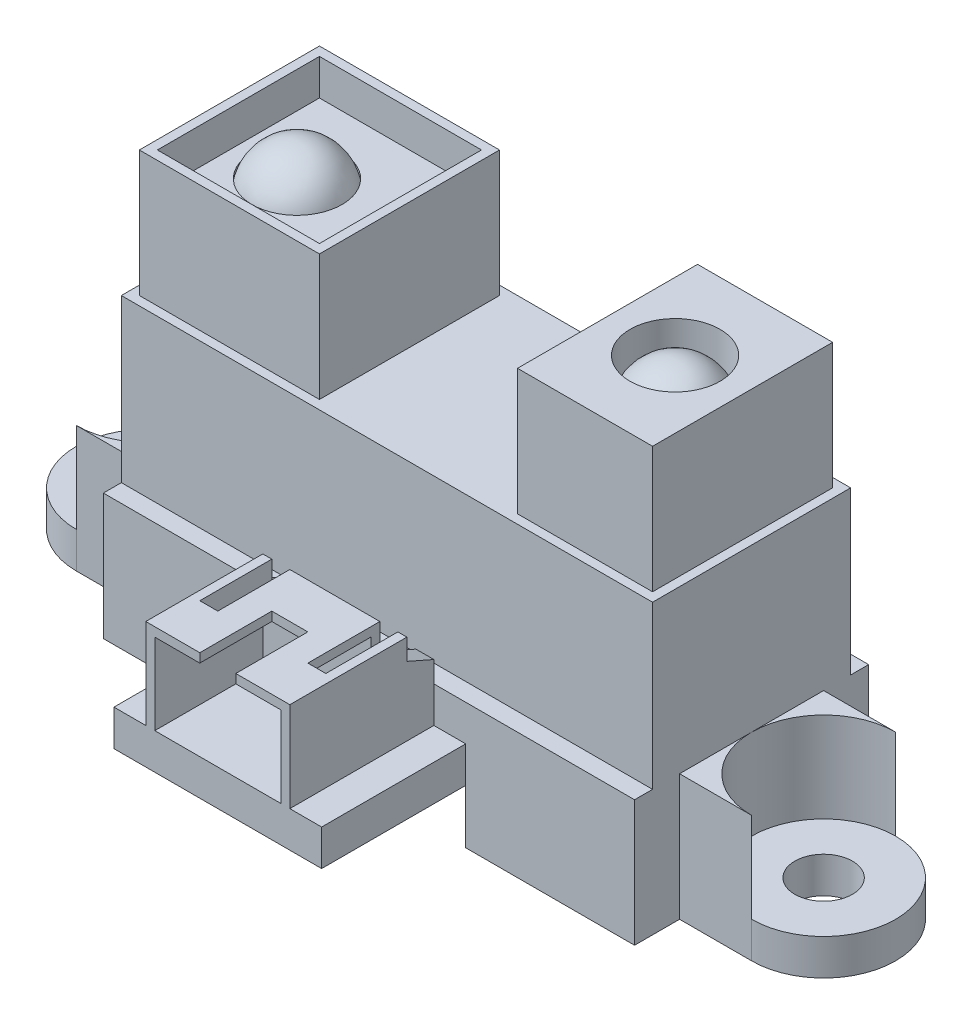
ISO-10303-21;
HEADER;
FILE_DESCRIPTION(('STEP AP214'),'2;1');
FILE_NAME('part.step','',(''),(''),'','','');
FILE_SCHEMA(('AUTOMOTIVE_DESIGN { 1 0 10303 214 1 1 1 1 }'));
ENDSEC;
DATA;
#1=APPLICATION_CONTEXT('core data for automotive mechanical design processes');
#2=APPLICATION_PROTOCOL_DEFINITION('international standard','automotive_design',2000,#1);
#3=PRODUCT_CONTEXT('',#1,'mechanical');
#4=PRODUCT('Part','Part','',(#3));
#5=PRODUCT_RELATED_PRODUCT_CATEGORY('part','',(#4));
#6=PRODUCT_DEFINITION_FORMATION('','',#4);
#7=PRODUCT_DEFINITION_CONTEXT('part definition',#1,'design');
#8=PRODUCT_DEFINITION('design','',#6,#7);
#9=PRODUCT_DEFINITION_SHAPE('','',#8);
#10=(LENGTH_UNIT() NAMED_UNIT(*) SI_UNIT(.MILLI.,.METRE.));
#11=(NAMED_UNIT(*) PLANE_ANGLE_UNIT() SI_UNIT($,.RADIAN.));
#12=(NAMED_UNIT(*) SI_UNIT($,.STERADIAN.) SOLID_ANGLE_UNIT());
#13=UNCERTAINTY_MEASURE_WITH_UNIT(LENGTH_MEASURE(1.E-05),#10,'distance_accuracy_value','');
#14=(GEOMETRIC_REPRESENTATION_CONTEXT(3) GLOBAL_UNCERTAINTY_ASSIGNED_CONTEXT((#13)) GLOBAL_UNIT_ASSIGNED_CONTEXT((#10,
#11,#12)) REPRESENTATION_CONTEXT('',''));
#15=CARTESIAN_POINT('',(0.,0.,0.));
#16=DIRECTION('',(0.,0.,1.));
#17=DIRECTION('',(1.,0.,0.));
#18=AXIS2_PLACEMENT_3D('',#15,#16,#17);
#19=CARTESIAN_POINT('',(8.58911536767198,5.,21.));
#20=DIRECTION('',(0.,-1.,0.));
#21=DIRECTION('',(0.,0.,-1.));
#22=AXIS2_PLACEMENT_3D('',#19,#20,#21);
#23=PLANE('',#22);
#24=DIRECTION('',(0.,0.,1.));
#25=VECTOR('',#24,1.);
#26=CARTESIAN_POINT('',(10.3559899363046,5.,14.5));
#27=LINE('',#26,#25);
#28=CARTESIAN_POINT('',(10.3559899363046,5.,13.));
#29=VERTEX_POINT('',#28);
#30=CARTESIAN_POINT('',(10.3559899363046,5.,21.));
#31=VERTEX_POINT('',#30);
#32=EDGE_CURVE('E660',#29,#31,#27,.T.);
#33=ORIENTED_EDGE('',*,*,#32,.F.);
#34=DIRECTION('',(-1.,0.,0.));
#35=VECTOR('',#34,1.);
#36=CARTESIAN_POINT('',(8.58911536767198,5.,13.));
#37=LINE('',#36,#35);
#38=CARTESIAN_POINT('',(8.58911536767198,5.,13.));
#39=VERTEX_POINT('',#38);
#40=EDGE_CURVE('E771',#29,#39,#37,.T.);
#41=ORIENTED_EDGE('',*,*,#40,.T.);
#42=DIRECTION('',(0.,0.,-1.));
#43=VECTOR('',#42,1.);
#44=CARTESIAN_POINT('',(8.58911536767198,5.,21.));
#45=LINE('',#44,#43);
#46=CARTESIAN_POINT('',(8.58911536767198,5.,21.));
#47=VERTEX_POINT('',#46);
#48=EDGE_CURVE('E888',#47,#39,#45,.T.);
#49=ORIENTED_EDGE('',*,*,#48,.F.);
#50=DIRECTION('',(-1.,0.,0.));
#51=VECTOR('',#50,1.);
#52=CARTESIAN_POINT('',(8.58911536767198,5.,21.));
#53=LINE('',#52,#51);
#54=EDGE_CURVE('E878',#31,#47,#53,.T.);
#55=ORIENTED_EDGE('',*,*,#54,.F.);
#56=EDGE_LOOP('',(#33,#41,#49,#55));
#57=FACE_BOUND('',#56,.T.);
#58=ADVANCED_FACE('F36',(#57),#23,.F.);
#59=CARTESIAN_POINT('',(0.,7.,13.));
#60=DIRECTION('',(0.,0.,-1.));
#61=DIRECTION('',(-1.,0.,0.));
#62=AXIS2_PLACEMENT_3D('',#59,#60,#61);
#63=PLANE('',#62);
#64=DIRECTION('',(0.,-1.,0.));
#65=VECTOR('',#64,1.);
#66=CARTESIAN_POINT('',(10.3559899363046,8.17249752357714,13.));
#67=LINE('',#66,#65);
#68=CARTESIAN_POINT('',(10.3559899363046,7.,13.));
#69=VERTEX_POINT('',#68);
#70=EDGE_CURVE('E611',#69,#29,#67,.T.);
#71=ORIENTED_EDGE('',*,*,#70,.F.);
#72=DIRECTION('',(1.,0.,0.));
#73=VECTOR('',#72,1.);
#74=CARTESIAN_POINT('',(0.,7.,13.));
#75=LINE('',#74,#73);
#76=CARTESIAN_POINT('',(0.,7.,13.));
#77=VERTEX_POINT('',#76);
#78=EDGE_CURVE('E1202',#77,#69,#75,.T.);
#79=ORIENTED_EDGE('',*,*,#78,.F.);
#80=DIRECTION('',(0.,-1.,0.));
#81=VECTOR('',#80,1.);
#82=CARTESIAN_POINT('',(0.,7.,13.));
#83=LINE('',#82,#81);
#84=CARTESIAN_POINT('',(0.,0.,13.));
#85=VERTEX_POINT('',#84);
#86=EDGE_CURVE('E1157',#77,#85,#83,.T.);
#87=ORIENTED_EDGE('',*,*,#86,.T.);
#88=DIRECTION('',(1.,0.,0.));
#89=VECTOR('',#88,1.);
#90=CARTESIAN_POINT('',(0.,0.,13.));
#91=LINE('',#90,#89);
#92=CARTESIAN_POINT('',(8.58911536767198,0.,13.));
#93=VERTEX_POINT('',#92);
#94=EDGE_CURVE('E1124',#85,#93,#91,.T.);
#95=ORIENTED_EDGE('',*,*,#94,.T.);
#96=DIRECTION('',(0.,1.,0.));
#97=VECTOR('',#96,1.);
#98=CARTESIAN_POINT('',(8.58911536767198,7.,13.));
#99=LINE('',#98,#97);
#100=CARTESIAN_POINT('',(8.58911536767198,3.,13.));
#101=VERTEX_POINT('',#100);
#102=EDGE_CURVE('E710',#93,#101,#99,.T.);
#103=ORIENTED_EDGE('',*,*,#102,.T.);
#104=DIRECTION('',(0.,-1.,0.));
#105=VECTOR('',#104,1.);
#106=CARTESIAN_POINT('',(8.58911536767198,5.,13.));
#107=LINE('',#106,#105);
#108=EDGE_CURVE('E776',#39,#101,#107,.T.);
#109=ORIENTED_EDGE('',*,*,#108,.F.);
#110=ORIENTED_EDGE('',*,*,#40,.F.);
#111=EDGE_LOOP('',(#71,#79,#87,#95,#103,#109,#110));
#112=FACE_BOUND('',#111,.T.);
#113=ADVANCED_FACE('F1199',(#112),#63,.F.);
#114=CARTESIAN_POINT('',(17.3559899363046,5.,13.));
#115=VERTEX_POINT('',#114);
#116=CARTESIAN_POINT('',(11.3559899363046,5.,13.));
#117=VERTEX_POINT('',#116);
#118=EDGE_CURVE('E773',#115,#117,#37,.T.);
#119=ORIENTED_EDGE('',*,*,#118,.T.);
#120=DIRECTION('',(0.,0.,1.));
#121=VECTOR('',#120,1.);
#122=CARTESIAN_POINT('',(11.3559899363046,5.,13.));
#123=LINE('',#122,#121);
#124=CARTESIAN_POINT('',(11.3559899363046,5.,14.5));
#125=VERTEX_POINT('',#124);
#126=EDGE_CURVE('E605',#117,#125,#123,.T.);
#127=ORIENTED_EDGE('',*,*,#126,.T.);
#128=DIRECTION('',(-1.,0.,0.));
#129=VECTOR('',#128,1.);
#130=CARTESIAN_POINT('',(18.3559899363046,5.,14.5));
#131=LINE('',#130,#129);
#132=CARTESIAN_POINT('',(17.3559899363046,5.,14.5));
#133=VERTEX_POINT('',#132);
#134=EDGE_CURVE('E657',#133,#125,#131,.T.);
#135=ORIENTED_EDGE('',*,*,#134,.F.);
#136=DIRECTION('',(0.,0.,-1.));
#137=VECTOR('',#136,1.);
#138=CARTESIAN_POINT('',(17.3559899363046,5.,13.));
#139=LINE('',#138,#137);
#140=EDGE_CURVE('E621',#133,#115,#139,.T.);
#141=ORIENTED_EDGE('',*,*,#140,.T.);
#142=EDGE_LOOP('',(#119,#127,#135,#141));
#143=FACE_BOUND('',#142,.T.);
#144=ADVANCED_FACE('F1273',(#143),#23,.F.);
#145=CARTESIAN_POINT('',(11.3559899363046,7.,13.));
#146=VERTEX_POINT('',#145);
#147=CARTESIAN_POINT('',(17.3559899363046,7.,13.));
#148=VERTEX_POINT('',#147);
#149=EDGE_CURVE('E1206',#146,#148,#75,.T.);
#150=ORIENTED_EDGE('',*,*,#149,.F.);
#151=DIRECTION('',(0.,-1.,0.));
#152=VECTOR('',#151,1.);
#153=CARTESIAN_POINT('',(11.3559899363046,8.17249752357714,13.));
#154=LINE('',#153,#152);
#155=EDGE_CURVE('E601',#146,#117,#154,.T.);
#156=ORIENTED_EDGE('',*,*,#155,.T.);
#157=ORIENTED_EDGE('',*,*,#118,.F.);
#158=DIRECTION('',(0.,1.,0.));
#159=VECTOR('',#158,1.);
#160=CARTESIAN_POINT('',(17.3559899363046,8.17249752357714,13.));
#161=LINE('',#160,#159);
#162=EDGE_CURVE('E625',#115,#148,#161,.T.);
#163=ORIENTED_EDGE('',*,*,#162,.T.);
#164=EDGE_LOOP('',(#150,#156,#157,#163));
#165=FACE_BOUND('',#164,.T.);
#166=ADVANCED_FACE('F1279',(#165),#63,.F.);
#167=CARTESIAN_POINT('',(20.1228645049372,5.,13.));
#168=VERTEX_POINT('',#167);
#169=CARTESIAN_POINT('',(18.3559899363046,5.,13.));
#170=VERTEX_POINT('',#169);
#171=EDGE_CURVE('E775',#168,#170,#37,.T.);
#172=ORIENTED_EDGE('',*,*,#171,.T.);
#173=DIRECTION('',(0.,0.,-1.));
#174=VECTOR('',#173,1.);
#175=CARTESIAN_POINT('',(18.3559899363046,5.,14.5));
#176=LINE('',#175,#174);
#177=CARTESIAN_POINT('',(18.3559899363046,5.,21.));
#178=VERTEX_POINT('',#177);
#179=EDGE_CURVE('E640',#178,#170,#176,.T.);
#180=ORIENTED_EDGE('',*,*,#179,.F.);
#181=CARTESIAN_POINT('',(20.1228645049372,5.,21.));
#182=VERTEX_POINT('',#181);
#183=EDGE_CURVE('E884',#182,#178,#53,.T.);
#184=ORIENTED_EDGE('',*,*,#183,.F.);
#185=DIRECTION('',(0.,0.,-1.));
#186=VECTOR('',#185,1.);
#187=CARTESIAN_POINT('',(20.1228645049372,5.,21.));
#188=LINE('',#187,#186);
#189=EDGE_CURVE('E893',#182,#168,#188,.T.);
#190=ORIENTED_EDGE('',*,*,#189,.T.);
#191=EDGE_LOOP('',(#172,#180,#184,#190));
#192=FACE_BOUND('',#191,.T.);
#193=ADVANCED_FACE('F1274',(#192),#23,.F.);
#194=CARTESIAN_POINT('',(18.3559899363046,7.,13.));
#195=VERTEX_POINT('',#194);
#196=CARTESIAN_POINT('',(29.5,7.,13.));
#197=VERTEX_POINT('',#196);
#198=EDGE_CURVE('E1208',#195,#197,#75,.T.);
#199=ORIENTED_EDGE('',*,*,#198,.F.);
#200=DIRECTION('',(0.,1.,0.));
#201=VECTOR('',#200,1.);
#202=CARTESIAN_POINT('',(18.3559899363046,8.17249752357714,13.));
#203=LINE('',#202,#201);
#204=EDGE_CURVE('E632',#170,#195,#203,.T.);
#205=ORIENTED_EDGE('',*,*,#204,.F.);
#206=ORIENTED_EDGE('',*,*,#171,.F.);
#207=DIRECTION('',(0.,1.,0.));
#208=VECTOR('',#207,1.);
#209=CARTESIAN_POINT('',(20.1228645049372,5.,13.));
#210=LINE('',#209,#208);
#211=CARTESIAN_POINT('',(20.1228645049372,3.,13.));
#212=VERTEX_POINT('',#211);
#213=EDGE_CURVE('E770',#212,#168,#210,.T.);
#214=ORIENTED_EDGE('',*,*,#213,.F.);
#215=CARTESIAN_POINT('',(20.1228645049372,0.,13.));
#216=VERTEX_POINT('',#215);
#217=EDGE_CURVE('E763',#216,#212,#210,.T.);
#218=ORIENTED_EDGE('',*,*,#217,.F.);
#219=CARTESIAN_POINT('',(29.5,0.,13.));
#220=VERTEX_POINT('',#219);
#221=EDGE_CURVE('E758',#216,#220,#91,.T.);
#222=ORIENTED_EDGE('',*,*,#221,.T.);
#223=DIRECTION('',(0.,-1.,0.));
#224=VECTOR('',#223,1.);
#225=CARTESIAN_POINT('',(29.5,7.,13.));
#226=LINE('',#225,#224);
#227=EDGE_CURVE('E1111',#197,#220,#226,.T.);
#228=ORIENTED_EDGE('',*,*,#227,.F.);
#229=EDGE_LOOP('',(#199,#205,#206,#214,#218,#222,#228));
#230=FACE_BOUND('',#229,.T.);
#231=ADVANCED_FACE('F766',(#230),#63,.F.);
#232=CARTESIAN_POINT('',(0.,16.,0.));
#233=DIRECTION('',(0.,1.,0.));
#234=DIRECTION('',(0.,0.,1.));
#235=AXIS2_PLACEMENT_3D('',#232,#233,#234);
#236=PLANE('',#235);
#237=DIRECTION('',(0.,0.,1.));
#238=VECTOR('',#237,1.);
#239=CARTESIAN_POINT('',(21.5,16.,1.5));
#240=LINE('',#239,#238);
#241=CARTESIAN_POINT('',(21.5,16.,1.5));
#242=VERTEX_POINT('',#241);
#243=CARTESIAN_POINT('',(21.5,16.,11.5));
#244=VERTEX_POINT('',#243);
#245=EDGE_CURVE('E999',#242,#244,#240,.T.);
#246=ORIENTED_EDGE('',*,*,#245,.F.);
#247=DIRECTION('',(-1.,0.,0.));
#248=VECTOR('',#247,1.);
#249=CARTESIAN_POINT('',(29.,16.,1.5));
#250=LINE('',#249,#248);
#251=CARTESIAN_POINT('',(29.,16.,1.5));
#252=VERTEX_POINT('',#251);
#253=EDGE_CURVE('E985',#252,#242,#250,.T.);
#254=ORIENTED_EDGE('',*,*,#253,.F.);
#255=DIRECTION('',(0.,0.,-1.));
#256=VECTOR('',#255,1.);
#257=CARTESIAN_POINT('',(29.,16.,11.5));
#258=LINE('',#257,#256);
#259=CARTESIAN_POINT('',(29.,16.,11.5));
#260=VERTEX_POINT('',#259);
#261=EDGE_CURVE('E990',#260,#252,#258,.T.);
#262=ORIENTED_EDGE('',*,*,#261,.F.);
#263=DIRECTION('',(1.,0.,0.));
#264=VECTOR('',#263,1.);
#265=CARTESIAN_POINT('',(21.5,16.,11.5));
#266=LINE('',#265,#264);
#267=EDGE_CURVE('E1001',#244,#260,#266,.T.);
#268=ORIENTED_EDGE('',*,*,#267,.F.);
#269=EDGE_LOOP('',(#246,#254,#262,#268));
#270=FACE_BOUND('',#269,.T.);
#271=DIRECTION('',(0.,0.,1.));
#272=VECTOR('',#271,1.);
#273=CARTESIAN_POINT('',(0.,16.,1.));
#274=LINE('',#273,#272);
#275=CARTESIAN_POINT('',(0.,16.,1.));
#276=VERTEX_POINT('',#275);
#277=CARTESIAN_POINT('',(0.,16.,12.));
#278=VERTEX_POINT('',#277);
#279=EDGE_CURVE('E1015',#276,#278,#274,.T.);
#280=ORIENTED_EDGE('',*,*,#279,.T.);
#281=DIRECTION('',(1.,0.,0.));
#282=VECTOR('',#281,1.);
#283=CARTESIAN_POINT('',(0.,16.,12.));
#284=LINE('',#283,#282);
#285=CARTESIAN_POINT('',(29.5,16.,12.));
#286=VERTEX_POINT('',#285);
#287=EDGE_CURVE('E1018',#278,#286,#284,.T.);
#288=ORIENTED_EDGE('',*,*,#287,.T.);
#289=DIRECTION('',(0.,0.,-1.));
#290=VECTOR('',#289,1.);
#291=CARTESIAN_POINT('',(29.5,16.,0.999999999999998));
#292=LINE('',#291,#290);
#293=CARTESIAN_POINT('',(29.5,16.,0.999999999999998));
#294=VERTEX_POINT('',#293);
#295=EDGE_CURVE('E1021',#286,#294,#292,.T.);
#296=ORIENTED_EDGE('',*,*,#295,.T.);
#297=DIRECTION('',(-1.,0.,0.));
#298=VECTOR('',#297,1.);
#299=CARTESIAN_POINT('',(0.,16.,1.));
#300=LINE('',#299,#298);
#301=EDGE_CURVE('E1023',#294,#276,#300,.T.);
#302=ORIENTED_EDGE('',*,*,#301,.T.);
#303=EDGE_LOOP('',(#280,#288,#296,#302));
#304=FACE_BOUND('',#303,.T.);
#305=DIRECTION('',(1.,0.,0.));
#306=VECTOR('',#305,1.);
#307=CARTESIAN_POINT('',(0.5,16.,11.5));
#308=LINE('',#307,#306);
#309=CARTESIAN_POINT('',(0.5,16.,11.5));
#310=VERTEX_POINT('',#309);
#311=CARTESIAN_POINT('',(10.5,16.,11.5));
#312=VERTEX_POINT('',#311);
#313=EDGE_CURVE('E970',#310,#312,#308,.T.);
#314=ORIENTED_EDGE('',*,*,#313,.F.);
#315=DIRECTION('',(0.,0.,1.));
#316=VECTOR('',#315,1.);
#317=CARTESIAN_POINT('',(0.5,16.,1.5));
#318=LINE('',#317,#316);
#319=CARTESIAN_POINT('',(0.5,16.,1.5));
#320=VERTEX_POINT('',#319);
#321=EDGE_CURVE('E950',#320,#310,#318,.T.);
#322=ORIENTED_EDGE('',*,*,#321,.F.);
#323=DIRECTION('',(-1.,0.,0.));
#324=VECTOR('',#323,1.);
#325=CARTESIAN_POINT('',(10.5,16.,1.5));
#326=LINE('',#325,#324);
#327=CARTESIAN_POINT('',(10.5,16.,1.5));
#328=VERTEX_POINT('',#327);
#329=EDGE_CURVE('E961',#328,#320,#326,.T.);
#330=ORIENTED_EDGE('',*,*,#329,.F.);
#331=DIRECTION('',(0.,0.,-1.));
#332=VECTOR('',#331,1.);
#333=CARTESIAN_POINT('',(10.5,16.,1.5));
#334=LINE('',#333,#332);
#335=EDGE_CURVE('E972',#312,#328,#334,.T.);
#336=ORIENTED_EDGE('',*,*,#335,.F.);
#337=EDGE_LOOP('',(#314,#322,#330,#336));
#338=FACE_BOUND('',#337,.T.);
#339=ADVANCED_FACE('F1290',(#270,#304,#338),#236,.T.);
#340=CARTESIAN_POINT('',(-4.,7.,6.5));
#341=DIRECTION('',(0.,1.,0.));
#342=DIRECTION('',(0.,0.,1.));
#343=AXIS2_PLACEMENT_3D('',#340,#341,#342);
#344=PLANE('',#343);
#345=DIRECTION('',(0.,0.,1.));
#346=VECTOR('',#345,1.);
#347=CARTESIAN_POINT('',(0.,7.,1.));
#348=LINE('',#347,#346);
#349=CARTESIAN_POINT('',(0.,7.,2.5));
#350=VERTEX_POINT('',#349);
#351=CARTESIAN_POINT('',(0.,7.,6.5));
#352=VERTEX_POINT('',#351);
#353=EDGE_CURVE('E790',#350,#352,#348,.T.);
#354=ORIENTED_EDGE('',*,*,#353,.F.);
#355=DIRECTION('',(-1.,0.,0.));
#356=VECTOR('',#355,1.);
#357=CARTESIAN_POINT('',(-4.,7.,2.5));
#358=LINE('',#357,#356);
#359=CARTESIAN_POINT('',(-4.,7.,2.5));
#360=VERTEX_POINT('',#359);
#361=EDGE_CURVE('E1066',#350,#360,#358,.T.);
#362=ORIENTED_EDGE('',*,*,#361,.T.);
#363=CARTESIAN_POINT('',(-4.,7.,6.5));
#364=DIRECTION('',(0.,1.,0.));
#365=DIRECTION('',(0.,0.,1.));
#366=AXIS2_PLACEMENT_3D('',#363,#364,#365);
#367=CIRCLE('',#366,4.);
#368=EDGE_CURVE('E1221',#352,#360,#367,.T.);
#369=ORIENTED_EDGE('',*,*,#368,.F.);
#370=EDGE_LOOP('',(#354,#362,#369));
#371=FACE_BOUND('',#370,.T.);
#372=ADVANCED_FACE('F1413',(#371),#344,.T.);
#373=CARTESIAN_POINT('',(0.,7.,10.5));
#374=VERTEX_POINT('',#373);
#375=EDGE_CURVE('E1048',#352,#374,#348,.T.);
#376=ORIENTED_EDGE('',*,*,#375,.F.);
#377=CARTESIAN_POINT('',(-4.,7.,10.5));
#378=VERTEX_POINT('',#377);
#379=EDGE_CURVE('E1217',#378,#352,#367,.T.);
#380=ORIENTED_EDGE('',*,*,#379,.F.);
#381=DIRECTION('',(1.,0.,0.));
#382=VECTOR('',#381,1.);
#383=CARTESIAN_POINT('',(-4.,7.,10.5));
#384=LINE('',#383,#382);
#385=EDGE_CURVE('E1052',#378,#374,#384,.T.);
#386=ORIENTED_EDGE('',*,*,#385,.T.);
#387=EDGE_LOOP('',(#376,#380,#386));
#388=FACE_BOUND('',#387,.T.);
#389=ADVANCED_FACE('F1455',(#388),#344,.T.);
#390=DIRECTION('',(-1.,0.,0.));
#391=VECTOR('',#390,1.);
#392=CARTESIAN_POINT('',(0.,7.,1.));
#393=LINE('',#392,#391);
#394=CARTESIAN_POINT('',(29.5,7.,0.999999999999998));
#395=VERTEX_POINT('',#394);
#396=CARTESIAN_POINT('',(0.,7.,0.999999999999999));
#397=VERTEX_POINT('',#396);
#398=EDGE_CURVE('E1019',#395,#397,#393,.T.);
#399=ORIENTED_EDGE('',*,*,#398,.F.);
#400=DIRECTION('',(0.,0.,-1.));
#401=VECTOR('',#400,1.);
#402=CARTESIAN_POINT('',(29.5,7.,0.));
#403=LINE('',#402,#401);
#404=CARTESIAN_POINT('',(29.5,7.,0.));
#405=VERTEX_POINT('',#404);
#406=EDGE_CURVE('E1095',#395,#405,#403,.T.);
#407=ORIENTED_EDGE('',*,*,#406,.T.);
#408=DIRECTION('',(-1.,0.,0.));
#409=VECTOR('',#408,1.);
#410=CARTESIAN_POINT('',(0.,7.,0.));
#411=LINE('',#410,#409);
#412=CARTESIAN_POINT('',(0.,7.,0.));
#413=VERTEX_POINT('',#412);
#414=EDGE_CURVE('E1148',#405,#413,#411,.T.);
#415=ORIENTED_EDGE('',*,*,#414,.T.);
#416=DIRECTION('',(0.,0.,1.));
#417=VECTOR('',#416,1.);
#418=CARTESIAN_POINT('',(0.,7.,0.));
#419=LINE('',#418,#417);
#420=EDGE_CURVE('E1069',#413,#397,#419,.T.);
#421=ORIENTED_EDGE('',*,*,#420,.T.);
#422=EDGE_LOOP('',(#399,#407,#415,#421));
#423=FACE_BOUND('',#422,.T.);
#424=ADVANCED_FACE('F1435',(#423),#344,.T.);
#425=DIRECTION('',(0.,0.,-1.));
#426=VECTOR('',#425,1.);
#427=CARTESIAN_POINT('',(29.5,7.,0.999999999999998));
#428=LINE('',#427,#426);
#429=CARTESIAN_POINT('',(29.5,7.,10.5));
#430=VERTEX_POINT('',#429);
#431=CARTESIAN_POINT('',(29.5,7.,6.5));
#432=VERTEX_POINT('',#431);
#433=EDGE_CURVE('E1051',#430,#432,#428,.T.);
#434=ORIENTED_EDGE('',*,*,#433,.F.);
#435=DIRECTION('',(1.,0.,0.));
#436=VECTOR('',#435,1.);
#437=CARTESIAN_POINT('',(33.5,7.,10.5));
#438=LINE('',#437,#436);
#439=CARTESIAN_POINT('',(33.5,7.,10.5));
#440=VERTEX_POINT('',#439);
#441=EDGE_CURVE('E1096',#430,#440,#438,.T.);
#442=ORIENTED_EDGE('',*,*,#441,.T.);
#443=CARTESIAN_POINT('',(33.5,7.,6.5));
#444=DIRECTION('',(0.,1.,0.));
#445=DIRECTION('',(0.,0.,1.));
#446=AXIS2_PLACEMENT_3D('',#443,#444,#445);
#447=CIRCLE('',#446,4.);
#448=EDGE_CURVE('E1075',#432,#440,#447,.T.);
#449=ORIENTED_EDGE('',*,*,#448,.F.);
#450=EDGE_LOOP('',(#434,#442,#449));
#451=FACE_BOUND('',#450,.T.);
#452=ADVANCED_FACE('F1256',(#451),#344,.T.);
#453=CARTESIAN_POINT('',(29.5,7.,2.5));
#454=VERTEX_POINT('',#453);
#455=EDGE_CURVE('E1089',#432,#454,#428,.T.);
#456=ORIENTED_EDGE('',*,*,#455,.F.);
#457=CARTESIAN_POINT('',(33.5,7.,2.5));
#458=VERTEX_POINT('',#457);
#459=EDGE_CURVE('E1092',#458,#432,#447,.T.);
#460=ORIENTED_EDGE('',*,*,#459,.F.);
#461=DIRECTION('',(-1.,0.,0.));
#462=VECTOR('',#461,1.);
#463=CARTESIAN_POINT('',(33.5,7.,2.5));
#464=LINE('',#463,#462);
#465=EDGE_CURVE('E1093',#458,#454,#464,.T.);
#466=ORIENTED_EDGE('',*,*,#465,.T.);
#467=EDGE_LOOP('',(#456,#460,#466));
#468=FACE_BOUND('',#467,.T.);
#469=ADVANCED_FACE('F1254',(#468),#344,.T.);
#470=CARTESIAN_POINT('',(33.5,7.,6.5));
#471=DIRECTION('',(0.,-1.,0.));
#472=DIRECTION('',(0.,0.,-1.));
#473=AXIS2_PLACEMENT_3D('',#470,#471,#472);
#474=CYLINDRICAL_SURFACE('',#473,4.);
#475=CARTESIAN_POINT('',(33.5,2.,6.5));
#476=DIRECTION('',(0.,1.,0.));
#477=DIRECTION('',(0.,0.,1.));
#478=AXIS2_PLACEMENT_3D('',#475,#476,#477);
#479=CIRCLE('',#478,4.);
#480=CARTESIAN_POINT('',(33.5,2.,10.5));
#481=VERTEX_POINT('',#480);
#482=CARTESIAN_POINT('',(33.5,2.,2.5));
#483=VERTEX_POINT('',#482);
#484=EDGE_CURVE('E1223',#481,#483,#479,.T.);
#485=ORIENTED_EDGE('',*,*,#484,.F.);
#486=DIRECTION('',(0.,-1.,0.));
#487=VECTOR('',#486,1.);
#488=CARTESIAN_POINT('',(33.5,7.,10.5));
#489=LINE('',#488,#487);
#490=CARTESIAN_POINT('',(33.5,0.,10.5));
#491=VERTEX_POINT('',#490);
#492=EDGE_CURVE('E1154',#481,#491,#489,.T.);
#493=ORIENTED_EDGE('',*,*,#492,.T.);
#494=CARTESIAN_POINT('',(33.5,0.,6.5));
#495=DIRECTION('',(0.,1.,0.));
#496=DIRECTION('',(0.,0.,1.));
#497=AXIS2_PLACEMENT_3D('',#494,#495,#496);
#498=CIRCLE('',#497,4.);
#499=CARTESIAN_POINT('',(33.5,0.,2.5));
#500=VERTEX_POINT('',#499);
#501=EDGE_CURVE('E1136',#491,#500,#498,.T.);
#502=ORIENTED_EDGE('',*,*,#501,.T.);
#503=DIRECTION('',(0.,-1.,0.));
#504=VECTOR('',#503,1.);
#505=CARTESIAN_POINT('',(33.5,7.,2.5));
#506=LINE('',#505,#504);
#507=EDGE_CURVE('E1102',#483,#500,#506,.T.);
#508=ORIENTED_EDGE('',*,*,#507,.F.);
#509=EDGE_LOOP('',(#485,#493,#502,#508));
#510=FACE_BOUND('',#509,.T.);
#511=ADVANCED_FACE('F1233',(#510),#474,.T.);
#512=CARTESIAN_POINT('',(-4.,7.,6.5));
#513=DIRECTION('',(0.,-1.,0.));
#514=DIRECTION('',(0.,0.,-1.));
#515=AXIS2_PLACEMENT_3D('',#512,#513,#514);
#516=CYLINDRICAL_SURFACE('',#515,4.);
#517=CARTESIAN_POINT('',(-4.,2.,6.5));
#518=DIRECTION('',(0.,1.,0.));
#519=DIRECTION('',(0.,0.,1.));
#520=AXIS2_PLACEMENT_3D('',#517,#518,#519);
#521=CIRCLE('',#520,4.);
#522=CARTESIAN_POINT('',(-4.,2.,2.5));
#523=VERTEX_POINT('',#522);
#524=CARTESIAN_POINT('',(-4.,2.,10.5));
#525=VERTEX_POINT('',#524);
#526=EDGE_CURVE('E1220',#523,#525,#521,.T.);
#527=ORIENTED_EDGE('',*,*,#526,.F.);
#528=DIRECTION('',(0.,-1.,0.));
#529=VECTOR('',#528,1.);
#530=CARTESIAN_POINT('',(-4.,7.,2.5));
#531=LINE('',#530,#529);
#532=CARTESIAN_POINT('',(-4.,0.,2.5));
#533=VERTEX_POINT('',#532);
#534=EDGE_CURVE('E1164',#523,#533,#531,.T.);
#535=ORIENTED_EDGE('',*,*,#534,.T.);
#536=CARTESIAN_POINT('',(-4.,0.,6.5));
#537=DIRECTION('',(0.,1.,0.));
#538=DIRECTION('',(0.,0.,1.));
#539=AXIS2_PLACEMENT_3D('',#536,#537,#538);
#540=CIRCLE('',#539,4.);
#541=CARTESIAN_POINT('',(-4.,0.,10.5));
#542=VERTEX_POINT('',#541);
#543=EDGE_CURVE('E1184',#533,#542,#540,.T.);
#544=ORIENTED_EDGE('',*,*,#543,.T.);
#545=DIRECTION('',(0.,-1.,0.));
#546=VECTOR('',#545,1.);
#547=CARTESIAN_POINT('',(-4.,7.,10.5));
#548=LINE('',#547,#546);
#549=EDGE_CURVE('E1165',#525,#542,#548,.T.);
#550=ORIENTED_EDGE('',*,*,#549,.F.);
#551=EDGE_LOOP('',(#527,#535,#544,#550));
#552=FACE_BOUND('',#551,.T.);
#553=ADVANCED_FACE('F1461',(#552),#516,.T.);
#554=CARTESIAN_POINT('',(-4.,7.,2.5));
#555=DIRECTION('',(0.,0.,1.));
#556=DIRECTION('',(1.,0.,0.));
#557=AXIS2_PLACEMENT_3D('',#554,#555,#556);
#558=PLANE('',#557);
#559=DIRECTION('',(-1.,0.,0.));
#560=VECTOR('',#559,1.);
#561=CARTESIAN_POINT('',(-4.,0.,2.5));
#562=LINE('',#561,#560);
#563=CARTESIAN_POINT('',(0.,0.,2.5));
#564=VERTEX_POINT('',#563);
#565=EDGE_CURVE('E1180',#564,#533,#562,.T.);
#566=ORIENTED_EDGE('',*,*,#565,.T.);
#567=ORIENTED_EDGE('',*,*,#534,.F.);
#568=EDGE_CURVE('E1076',#360,#523,#531,.T.);
#569=ORIENTED_EDGE('',*,*,#568,.F.);
#570=ORIENTED_EDGE('',*,*,#361,.F.);
#571=DIRECTION('',(0.,-1.,0.));
#572=VECTOR('',#571,1.);
#573=CARTESIAN_POINT('',(0.,7.,2.5));
#574=LINE('',#573,#572);
#575=EDGE_CURVE('E1072',#350,#564,#574,.T.);
#576=ORIENTED_EDGE('',*,*,#575,.T.);
#577=EDGE_LOOP('',(#566,#567,#569,#570,#576));
#578=FACE_BOUND('',#577,.T.);
#579=ADVANCED_FACE('F1446',(#578),#558,.F.);
#580=CARTESIAN_POINT('',(-4.,7.,10.5));
#581=DIRECTION('',(0.,0.,-1.));
#582=DIRECTION('',(-1.,0.,0.));
#583=AXIS2_PLACEMENT_3D('',#580,#581,#582);
#584=PLANE('',#583);
#585=DIRECTION('',(1.,0.,0.));
#586=VECTOR('',#585,1.);
#587=CARTESIAN_POINT('',(-4.,0.,10.5));
#588=LINE('',#587,#586);
#589=CARTESIAN_POINT('',(0.,0.,10.5));
#590=VERTEX_POINT('',#589);
#591=EDGE_CURVE('E1186',#542,#590,#588,.T.);
#592=ORIENTED_EDGE('',*,*,#591,.T.);
#593=DIRECTION('',(0.,-1.,0.));
#594=VECTOR('',#593,1.);
#595=CARTESIAN_POINT('',(0.,7.,10.5));
#596=LINE('',#595,#594);
#597=EDGE_CURVE('E1160',#374,#590,#596,.T.);
#598=ORIENTED_EDGE('',*,*,#597,.F.);
#599=ORIENTED_EDGE('',*,*,#385,.F.);
#600=EDGE_CURVE('E1161',#378,#525,#548,.T.);
#601=ORIENTED_EDGE('',*,*,#600,.T.);
#602=ORIENTED_EDGE('',*,*,#549,.T.);
#603=EDGE_LOOP('',(#592,#598,#599,#601,#602));
#604=FACE_BOUND('',#603,.T.);
#605=ADVANCED_FACE('F1456',(#604),#584,.F.);
#606=CARTESIAN_POINT('',(0.,7.,10.5));
#607=DIRECTION('',(1.,0.,0.));
#608=DIRECTION('',(0.,0.,-1.));
#609=AXIS2_PLACEMENT_3D('',#606,#607,#608);
#610=PLANE('',#609);
#611=DIRECTION('',(0.,0.,1.));
#612=VECTOR('',#611,1.);
#613=CARTESIAN_POINT('',(0.,0.,10.5));
#614=LINE('',#613,#612);
#615=EDGE_CURVE('E1129',#590,#85,#614,.T.);
#616=ORIENTED_EDGE('',*,*,#615,.T.);
#617=ORIENTED_EDGE('',*,*,#86,.F.);
#618=DIRECTION('',(0.,0.,1.));
#619=VECTOR('',#618,1.);
#620=CARTESIAN_POINT('',(0.,7.,10.5));
#621=LINE('',#620,#619);
#622=CARTESIAN_POINT('',(0.,7.,12.));
#623=VERTEX_POINT('',#622);
#624=EDGE_CURVE('E1213',#623,#77,#621,.T.);
#625=ORIENTED_EDGE('',*,*,#624,.F.);
#626=DIRECTION('',(0.,-1.,0.));
#627=VECTOR('',#626,1.);
#628=CARTESIAN_POINT('',(0.,16.,12.));
#629=LINE('',#628,#627);
#630=EDGE_CURVE('E1039',#278,#623,#629,.T.);
#631=ORIENTED_EDGE('',*,*,#630,.F.);
#632=ORIENTED_EDGE('',*,*,#279,.F.);
#633=DIRECTION('',(0.,-1.,0.));
#634=VECTOR('',#633,1.);
#635=CARTESIAN_POINT('',(0.,16.,1.));
#636=LINE('',#635,#634);
#637=EDGE_CURVE('E1025',#276,#397,#636,.T.);
#638=ORIENTED_EDGE('',*,*,#637,.T.);
#639=ORIENTED_EDGE('',*,*,#420,.F.);
#640=DIRECTION('',(0.,-1.,0.));
#641=VECTOR('',#640,1.);
#642=CARTESIAN_POINT('',(0.,7.,0.));
#643=LINE('',#642,#641);
#644=CARTESIAN_POINT('',(0.,0.,0.));
#645=VERTEX_POINT('',#644);
#646=EDGE_CURVE('E1145',#413,#645,#643,.T.);
#647=ORIENTED_EDGE('',*,*,#646,.T.);
#648=DIRECTION('',(0.,0.,1.));
#649=VECTOR('',#648,1.);
#650=CARTESIAN_POINT('',(0.,0.,0.));
#651=LINE('',#650,#649);
#652=EDGE_CURVE('E1177',#645,#564,#651,.T.);
#653=ORIENTED_EDGE('',*,*,#652,.T.);
#654=ORIENTED_EDGE('',*,*,#575,.F.);
#655=ORIENTED_EDGE('',*,*,#353,.T.);
#656=ORIENTED_EDGE('',*,*,#375,.T.);
#657=ORIENTED_EDGE('',*,*,#597,.T.);
#658=EDGE_LOOP('',(#616,#617,#625,#631,#632,#638,#639,#647,#653,#654,#655,#656,#657));
#659=FACE_BOUND('',#658,.T.);
#660=ADVANCED_FACE('F1194',(#659),#610,.F.);
#661=CARTESIAN_POINT('',(33.5,7.,10.5));
#662=DIRECTION('',(0.,0.,-1.));
#663=DIRECTION('',(-1.,0.,0.));
#664=AXIS2_PLACEMENT_3D('',#661,#662,#663);
#665=PLANE('',#664);
#666=DIRECTION('',(1.,0.,0.));
#667=VECTOR('',#666,1.);
#668=CARTESIAN_POINT('',(33.5,0.,10.5));
#669=LINE('',#668,#667);
#670=CARTESIAN_POINT('',(29.5,0.,10.5));
#671=VERTEX_POINT('',#670);
#672=EDGE_CURVE('E1133',#671,#491,#669,.T.);
#673=ORIENTED_EDGE('',*,*,#672,.T.);
#674=ORIENTED_EDGE('',*,*,#492,.F.);
#675=EDGE_CURVE('E1112',#440,#481,#489,.T.);
#676=ORIENTED_EDGE('',*,*,#675,.F.);
#677=ORIENTED_EDGE('',*,*,#441,.F.);
#678=DIRECTION('',(0.,-1.,0.));
#679=VECTOR('',#678,1.);
#680=CARTESIAN_POINT('',(29.5,7.,10.5));
#681=LINE('',#680,#679);
#682=EDGE_CURVE('E1108',#430,#671,#681,.T.);
#683=ORIENTED_EDGE('',*,*,#682,.T.);
#684=EDGE_LOOP('',(#673,#674,#676,#677,#683));
#685=FACE_BOUND('',#684,.T.);
#686=ADVANCED_FACE('F1236',(#685),#665,.F.);
#687=CARTESIAN_POINT('',(33.5,7.,2.5));
#688=DIRECTION('',(0.,0.,1.));
#689=DIRECTION('',(1.,0.,0.));
#690=AXIS2_PLACEMENT_3D('',#687,#688,#689);
#691=PLANE('',#690);
#692=DIRECTION('',(-1.,0.,0.));
#693=VECTOR('',#692,1.);
#694=CARTESIAN_POINT('',(33.5,0.,2.5));
#695=LINE('',#694,#693);
#696=CARTESIAN_POINT('',(29.5,0.,2.5));
#697=VERTEX_POINT('',#696);
#698=EDGE_CURVE('E1139',#500,#697,#695,.T.);
#699=ORIENTED_EDGE('',*,*,#698,.T.);
#700=DIRECTION('',(0.,-1.,0.));
#701=VECTOR('',#700,1.);
#702=CARTESIAN_POINT('',(29.5,7.,2.5));
#703=LINE('',#702,#701);
#704=EDGE_CURVE('E1099',#454,#697,#703,.T.);
#705=ORIENTED_EDGE('',*,*,#704,.F.);
#706=ORIENTED_EDGE('',*,*,#465,.F.);
#707=EDGE_CURVE('E1151',#458,#483,#506,.T.);
#708=ORIENTED_EDGE('',*,*,#707,.T.);
#709=ORIENTED_EDGE('',*,*,#507,.T.);
#710=EDGE_LOOP('',(#699,#705,#706,#708,#709));
#711=FACE_BOUND('',#710,.T.);
#712=ADVANCED_FACE('F1246',(#711),#691,.F.);
#713=CARTESIAN_POINT('',(29.5,7.,0.));
#714=DIRECTION('',(-1.,0.,0.));
#715=DIRECTION('',(0.,0.,1.));
#716=AXIS2_PLACEMENT_3D('',#713,#714,#715);
#717=PLANE('',#716);
#718=DIRECTION('',(0.,0.,-1.));
#719=VECTOR('',#718,1.);
#720=CARTESIAN_POINT('',(29.5,0.,0.));
#721=LINE('',#720,#719);
#722=CARTESIAN_POINT('',(29.5,0.,0.));
#723=VERTEX_POINT('',#722);
#724=EDGE_CURVE('E1141',#697,#723,#721,.T.);
#725=ORIENTED_EDGE('',*,*,#724,.T.);
#726=DIRECTION('',(0.,-1.,0.));
#727=VECTOR('',#726,1.);
#728=CARTESIAN_POINT('',(29.5,7.,0.));
#729=LINE('',#728,#727);
#730=EDGE_CURVE('E1103',#405,#723,#729,.T.);
#731=ORIENTED_EDGE('',*,*,#730,.F.);
#732=ORIENTED_EDGE('',*,*,#406,.F.);
#733=DIRECTION('',(0.,-1.,0.));
#734=VECTOR('',#733,1.);
#735=CARTESIAN_POINT('',(29.5,16.,0.999999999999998));
#736=LINE('',#735,#734);
#737=EDGE_CURVE('E1040',#294,#395,#736,.T.);
#738=ORIENTED_EDGE('',*,*,#737,.F.);
#739=ORIENTED_EDGE('',*,*,#295,.F.);
#740=DIRECTION('',(0.,-1.,0.));
#741=VECTOR('',#740,1.);
#742=CARTESIAN_POINT('',(29.5,16.,12.));
#743=LINE('',#742,#741);
#744=CARTESIAN_POINT('',(29.5,7.,12.));
#745=VERTEX_POINT('',#744);
#746=EDGE_CURVE('E1036',#286,#745,#743,.T.);
#747=ORIENTED_EDGE('',*,*,#746,.T.);
#748=DIRECTION('',(0.,0.,-1.));
#749=VECTOR('',#748,1.);
#750=CARTESIAN_POINT('',(29.5,7.,10.5));
#751=LINE('',#750,#749);
#752=EDGE_CURVE('E1056',#197,#745,#751,.T.);
#753=ORIENTED_EDGE('',*,*,#752,.F.);
#754=ORIENTED_EDGE('',*,*,#227,.T.);
#755=DIRECTION('',(0.,0.,-1.));
#756=VECTOR('',#755,1.);
#757=CARTESIAN_POINT('',(29.5,0.,10.5));
#758=LINE('',#757,#756);
#759=EDGE_CURVE('E1125',#220,#671,#758,.T.);
#760=ORIENTED_EDGE('',*,*,#759,.T.);
#761=ORIENTED_EDGE('',*,*,#682,.F.);
#762=ORIENTED_EDGE('',*,*,#433,.T.);
#763=ORIENTED_EDGE('',*,*,#455,.T.);
#764=ORIENTED_EDGE('',*,*,#704,.T.);
#765=EDGE_LOOP('',(#725,#731,#732,#738,#739,#747,#753,#754,#760,#761,#762,#763,#764));
#766=FACE_BOUND('',#765,.T.);
#767=ADVANCED_FACE('F1249',(#766),#717,.F.);
#768=CARTESIAN_POINT('',(0.,7.,0.));
#769=DIRECTION('',(0.,0.,1.));
#770=DIRECTION('',(1.,0.,0.));
#771=AXIS2_PLACEMENT_3D('',#768,#769,#770);
#772=PLANE('',#771);
#773=DIRECTION('',(-1.,0.,0.));
#774=VECTOR('',#773,1.);
#775=CARTESIAN_POINT('',(0.,0.,0.));
#776=LINE('',#775,#774);
#777=EDGE_CURVE('E1143',#723,#645,#776,.T.);
#778=ORIENTED_EDGE('',*,*,#777,.T.);
#779=ORIENTED_EDGE('',*,*,#646,.F.);
#780=ORIENTED_EDGE('',*,*,#414,.F.);
#781=ORIENTED_EDGE('',*,*,#730,.T.);
#782=EDGE_LOOP('',(#778,#779,#780,#781));
#783=FACE_BOUND('',#782,.T.);
#784=ADVANCED_FACE('F1439',(#783),#772,.F.);
#785=DIRECTION('',(1.,0.,0.));
#786=VECTOR('',#785,1.);
#787=CARTESIAN_POINT('',(0.,7.,12.));
#788=LINE('',#787,#786);
#789=EDGE_CURVE('E1014',#623,#745,#788,.T.);
#790=ORIENTED_EDGE('',*,*,#789,.F.);
#791=ORIENTED_EDGE('',*,*,#624,.T.);
#792=ORIENTED_EDGE('',*,*,#78,.T.);
#793=EDGE_CURVE('E1205',#69,#146,#75,.T.);
#794=ORIENTED_EDGE('',*,*,#793,.T.);
#795=ORIENTED_EDGE('',*,*,#149,.T.);
#796=EDGE_CURVE('E1207',#148,#195,#75,.T.);
#797=ORIENTED_EDGE('',*,*,#796,.T.);
#798=ORIENTED_EDGE('',*,*,#198,.T.);
#799=ORIENTED_EDGE('',*,*,#752,.T.);
#800=EDGE_LOOP('',(#790,#791,#792,#794,#795,#797,#798,#799));
#801=FACE_BOUND('',#800,.T.);
#802=ADVANCED_FACE('F1839',(#801),#344,.T.);
#803=CARTESIAN_POINT('',(-4.,0.,6.5));
#804=DIRECTION('',(0.,1.,0.));
#805=DIRECTION('',(0.,0.,1.));
#806=AXIS2_PLACEMENT_3D('',#803,#804,#805);
#807=PLANE('',#806);
#808=CARTESIAN_POINT('',(33.5,0.,6.5));
#809=DIRECTION('',(0.,1.,0.));
#810=DIRECTION('',(0.,0.,1.));
#811=AXIS2_PLACEMENT_3D('',#808,#809,#810);
#812=CIRCLE('',#811,1.6);
#813=CARTESIAN_POINT('',(33.5,0.,8.1));
#814=VERTEX_POINT('',#813);
#815=EDGE_CURVE('E909',#814,#814,#812,.T.);
#816=ORIENTED_EDGE('',*,*,#815,.T.);
#817=EDGE_LOOP('',(#816));
#818=FACE_BOUND('',#817,.T.);
#819=CARTESIAN_POINT('',(-4.,0.,6.5));
#820=DIRECTION('',(0.,1.,0.));
#821=DIRECTION('',(0.,0.,1.));
#822=AXIS2_PLACEMENT_3D('',#819,#820,#821);
#823=CIRCLE('',#822,1.6);
#824=CARTESIAN_POINT('',(-4.,0.,8.1));
#825=VERTEX_POINT('',#824);
#826=EDGE_CURVE('E915',#825,#825,#823,.T.);
#827=ORIENTED_EDGE('',*,*,#826,.T.);
#828=EDGE_LOOP('',(#827));
#829=FACE_BOUND('',#828,.T.);
#830=ORIENTED_EDGE('',*,*,#221,.F.);
#831=DIRECTION('',(0.,0.,1.));
#832=VECTOR('',#831,1.);
#833=CARTESIAN_POINT('',(20.1228645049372,0.,21.));
#834=LINE('',#833,#832);
#835=CARTESIAN_POINT('',(20.1228645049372,0.,12.));
#836=VERTEX_POINT('',#835);
#837=EDGE_CURVE('E675',#836,#216,#834,.T.);
#838=ORIENTED_EDGE('',*,*,#837,.F.);
#839=DIRECTION('',(-1.,0.,0.));
#840=VECTOR('',#839,1.);
#841=CARTESIAN_POINT('',(28.5,0.,12.));
#842=LINE('',#841,#840);
#843=CARTESIAN_POINT('',(28.5,0.,12.));
#844=VERTEX_POINT('',#843);
#845=EDGE_CURVE('E709',#844,#836,#842,.T.);
#846=ORIENTED_EDGE('',*,*,#845,.F.);
#847=DIRECTION('',(0.,0.,1.));
#848=VECTOR('',#847,1.);
#849=CARTESIAN_POINT('',(28.5,0.,1.));
#850=LINE('',#849,#848);
#851=CARTESIAN_POINT('',(28.5,0.,1.));
#852=VERTEX_POINT('',#851);
#853=EDGE_CURVE('E746',#852,#844,#850,.T.);
#854=ORIENTED_EDGE('',*,*,#853,.F.);
#855=DIRECTION('',(1.,0.,0.));
#856=VECTOR('',#855,1.);
#857=CARTESIAN_POINT('',(1.,0.,1.));
#858=LINE('',#857,#856);
#859=CARTESIAN_POINT('',(1.,0.,1.));
#860=VERTEX_POINT('',#859);
#861=EDGE_CURVE('E744',#860,#852,#858,.T.);
#862=ORIENTED_EDGE('',*,*,#861,.F.);
#863=DIRECTION('',(0.,0.,-1.));
#864=VECTOR('',#863,1.);
#865=CARTESIAN_POINT('',(1.,0.,12.));
#866=LINE('',#865,#864);
#867=CARTESIAN_POINT('',(1.,0.,12.));
#868=VERTEX_POINT('',#867);
#869=EDGE_CURVE('E743',#868,#860,#866,.T.);
#870=ORIENTED_EDGE('',*,*,#869,.F.);
#871=DIRECTION('',(-1.,0.,0.));
#872=VECTOR('',#871,1.);
#873=CARTESIAN_POINT('',(8.58911536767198,0.,12.));
#874=LINE('',#873,#872);
#875=CARTESIAN_POINT('',(8.58911536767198,0.,12.));
#876=VERTEX_POINT('',#875);
#877=EDGE_CURVE('E701',#876,#868,#874,.T.);
#878=ORIENTED_EDGE('',*,*,#877,.F.);
#879=DIRECTION('',(0.,0.,-1.));
#880=VECTOR('',#879,1.);
#881=CARTESIAN_POINT('',(8.58911536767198,0.,21.));
#882=LINE('',#881,#880);
#883=EDGE_CURVE('E671',#93,#876,#882,.T.);
#884=ORIENTED_EDGE('',*,*,#883,.F.);
#885=ORIENTED_EDGE('',*,*,#94,.F.);
#886=ORIENTED_EDGE('',*,*,#615,.F.);
#887=ORIENTED_EDGE('',*,*,#591,.F.);
#888=ORIENTED_EDGE('',*,*,#543,.F.);
#889=ORIENTED_EDGE('',*,*,#565,.F.);
#890=ORIENTED_EDGE('',*,*,#652,.F.);
#891=ORIENTED_EDGE('',*,*,#777,.F.);
#892=ORIENTED_EDGE('',*,*,#724,.F.);
#893=ORIENTED_EDGE('',*,*,#698,.F.);
#894=ORIENTED_EDGE('',*,*,#501,.F.);
#895=ORIENTED_EDGE('',*,*,#672,.F.);
#896=ORIENTED_EDGE('',*,*,#759,.F.);
#897=EDGE_LOOP('',(#830,#838,#846,#854,#862,#870,#878,#884,#885,#886,#887,#888,#889,#890,#891,
#892,#893,#894,#895,#896));
#898=FACE_BOUND('',#897,.T.);
#899=ADVANCED_FACE('F739',(#818,#829,#898),#807,.F.);
#900=CARTESIAN_POINT('',(-4.,2.,6.5));
#901=DIRECTION('',(0.,1.,0.));
#902=DIRECTION('',(0.,0.,1.));
#903=AXIS2_PLACEMENT_3D('',#900,#901,#902);
#904=CYLINDRICAL_SURFACE('',#903,4.);
#905=EDGE_CURVE('E1181',#525,#523,#521,.T.);
#906=ORIENTED_EDGE('',*,*,#905,.F.);
#907=ORIENTED_EDGE('',*,*,#600,.F.);
#908=ORIENTED_EDGE('',*,*,#379,.T.);
#909=ORIENTED_EDGE('',*,*,#368,.T.);
#910=ORIENTED_EDGE('',*,*,#568,.T.);
#911=EDGE_LOOP('',(#906,#907,#908,#909,#910));
#912=FACE_BOUND('',#911,.T.);
#913=ADVANCED_FACE('F1268',(#912),#904,.F.);
#914=CARTESIAN_POINT('',(-4.,2.,6.5));
#915=DIRECTION('',(0.,1.,0.));
#916=DIRECTION('',(0.,0.,1.));
#917=AXIS2_PLACEMENT_3D('',#914,#915,#916);
#918=PLANE('',#917);
#919=CARTESIAN_POINT('',(-4.,2.,6.5));
#920=DIRECTION('',(0.,1.,0.));
#921=DIRECTION('',(0.,0.,1.));
#922=AXIS2_PLACEMENT_3D('',#919,#920,#921);
#923=CIRCLE('',#922,1.6);
#924=CARTESIAN_POINT('',(-4.,2.,8.1));
#925=VERTEX_POINT('',#924);
#926=EDGE_CURVE('E912',#925,#925,#923,.T.);
#927=ORIENTED_EDGE('',*,*,#926,.F.);
#928=EDGE_LOOP('',(#927));
#929=FACE_BOUND('',#928,.T.);
#930=ORIENTED_EDGE('',*,*,#905,.T.);
#931=ORIENTED_EDGE('',*,*,#526,.T.);
#932=EDGE_LOOP('',(#930,#931));
#933=FACE_BOUND('',#932,.T.);
#934=ADVANCED_FACE('F1259',(#929,#933),#918,.T.);
#935=CARTESIAN_POINT('',(33.5,2.,6.5));
#936=DIRECTION('',(0.,1.,0.));
#937=DIRECTION('',(0.,0.,1.));
#938=AXIS2_PLACEMENT_3D('',#935,#936,#937);
#939=CYLINDRICAL_SURFACE('',#938,4.);
#940=EDGE_CURVE('E1045',#483,#481,#479,.T.);
#941=ORIENTED_EDGE('',*,*,#940,.F.);
#942=ORIENTED_EDGE('',*,*,#707,.F.);
#943=ORIENTED_EDGE('',*,*,#459,.T.);
#944=ORIENTED_EDGE('',*,*,#448,.T.);
#945=ORIENTED_EDGE('',*,*,#675,.T.);
#946=EDGE_LOOP('',(#941,#942,#943,#944,#945));
#947=FACE_BOUND('',#946,.T.);
#948=ADVANCED_FACE('F1257',(#947),#939,.F.);
#949=CARTESIAN_POINT('',(33.5,2.,6.5));
#950=DIRECTION('',(0.,1.,0.));
#951=DIRECTION('',(0.,0.,1.));
#952=AXIS2_PLACEMENT_3D('',#949,#950,#951);
#953=PLANE('',#952);
#954=CARTESIAN_POINT('',(33.5,2.,6.5));
#955=DIRECTION('',(0.,1.,0.));
#956=DIRECTION('',(0.,0.,1.));
#957=AXIS2_PLACEMENT_3D('',#954,#955,#956);
#958=CIRCLE('',#957,1.6);
#959=CARTESIAN_POINT('',(33.5,2.,8.1));
#960=VERTEX_POINT('',#959);
#961=EDGE_CURVE('E906',#960,#960,#958,.T.);
#962=ORIENTED_EDGE('',*,*,#961,.F.);
#963=EDGE_LOOP('',(#962));
#964=FACE_BOUND('',#963,.T.);
#965=ORIENTED_EDGE('',*,*,#484,.T.);
#966=ORIENTED_EDGE('',*,*,#940,.T.);
#967=EDGE_LOOP('',(#965,#966));
#968=FACE_BOUND('',#967,.T.);
#969=ADVANCED_FACE('F1229',(#964,#968),#953,.T.);
#970=CARTESIAN_POINT('',(0.,16.,12.));
#971=DIRECTION('',(0.,0.,-1.));
#972=DIRECTION('',(-1.,0.,0.));
#973=AXIS2_PLACEMENT_3D('',#970,#971,#972);
#974=PLANE('',#973);
#975=ORIENTED_EDGE('',*,*,#789,.T.);
#976=ORIENTED_EDGE('',*,*,#746,.F.);
#977=ORIENTED_EDGE('',*,*,#287,.F.);
#978=ORIENTED_EDGE('',*,*,#630,.T.);
#979=EDGE_LOOP('',(#975,#976,#977,#978));
#980=FACE_BOUND('',#979,.T.);
#981=ADVANCED_FACE('F1265',(#980),#974,.F.);
#982=CARTESIAN_POINT('',(0.,16.,1.));
#983=DIRECTION('',(0.,0.,1.));
#984=DIRECTION('',(1.,0.,0.));
#985=AXIS2_PLACEMENT_3D('',#982,#983,#984);
#986=PLANE('',#985);
#987=ORIENTED_EDGE('',*,*,#398,.T.);
#988=ORIENTED_EDGE('',*,*,#637,.F.);
#989=ORIENTED_EDGE('',*,*,#301,.F.);
#990=ORIENTED_EDGE('',*,*,#737,.T.);
#991=EDGE_LOOP('',(#987,#988,#989,#990));
#992=FACE_BOUND('',#991,.T.);
#993=ADVANCED_FACE('F1409',(#992),#986,.F.);
#994=CARTESIAN_POINT('',(29.,23.,1.5));
#995=DIRECTION('',(0.,0.,1.));
#996=DIRECTION('',(1.,0.,0.));
#997=AXIS2_PLACEMENT_3D('',#994,#995,#996);
#998=PLANE('',#997);
#999=ORIENTED_EDGE('',*,*,#253,.T.);
#1000=DIRECTION('',(0.,-1.,0.));
#1001=VECTOR('',#1000,1.);
#1002=CARTESIAN_POINT('',(21.5,23.,1.5));
#1003=LINE('',#1002,#1001);
#1004=CARTESIAN_POINT('',(21.5,23.,1.5));
#1005=VERTEX_POINT('',#1004);
#1006=EDGE_CURVE('E1012',#1005,#242,#1003,.T.);
#1007=ORIENTED_EDGE('',*,*,#1006,.F.);
#1008=DIRECTION('',(-1.,0.,0.));
#1009=VECTOR('',#1008,1.);
#1010=CARTESIAN_POINT('',(29.,23.,1.5));
#1011=LINE('',#1010,#1009);
#1012=CARTESIAN_POINT('',(29.,23.,1.5));
#1013=VERTEX_POINT('',#1012);
#1014=EDGE_CURVE('E986',#1013,#1005,#1011,.T.);
#1015=ORIENTED_EDGE('',*,*,#1014,.F.);
#1016=DIRECTION('',(0.,-1.,0.));
#1017=VECTOR('',#1016,1.);
#1018=CARTESIAN_POINT('',(29.,23.,1.5));
#1019=LINE('',#1018,#1017);
#1020=EDGE_CURVE('E996',#1013,#252,#1019,.T.);
#1021=ORIENTED_EDGE('',*,*,#1020,.T.);
#1022=EDGE_LOOP('',(#999,#1007,#1015,#1021));
#1023=FACE_BOUND('',#1022,.T.);
#1024=ADVANCED_FACE('F1405',(#1023),#998,.F.);
#1025=CARTESIAN_POINT('',(21.5,23.,1.5));
#1026=DIRECTION('',(1.,0.,0.));
#1027=DIRECTION('',(0.,0.,-1.));
#1028=AXIS2_PLACEMENT_3D('',#1025,#1026,#1027);
#1029=PLANE('',#1028);
#1030=ORIENTED_EDGE('',*,*,#245,.T.);
#1031=DIRECTION('',(0.,-1.,0.));
#1032=VECTOR('',#1031,1.);
#1033=CARTESIAN_POINT('',(21.5,23.,11.5));
#1034=LINE('',#1033,#1032);
#1035=CARTESIAN_POINT('',(21.5,23.,11.5));
#1036=VERTEX_POINT('',#1035);
#1037=EDGE_CURVE('E1009',#1036,#244,#1034,.T.);
#1038=ORIENTED_EDGE('',*,*,#1037,.F.);
#1039=DIRECTION('',(0.,0.,1.));
#1040=VECTOR('',#1039,1.);
#1041=CARTESIAN_POINT('',(21.5,23.,1.5));
#1042=LINE('',#1041,#1040);
#1043=EDGE_CURVE('E989',#1005,#1036,#1042,.T.);
#1044=ORIENTED_EDGE('',*,*,#1043,.F.);
#1045=ORIENTED_EDGE('',*,*,#1006,.T.);
#1046=EDGE_LOOP('',(#1030,#1038,#1044,#1045));
#1047=FACE_BOUND('',#1046,.T.);
#1048=ADVANCED_FACE('F1401',(#1047),#1029,.F.);
#1049=CARTESIAN_POINT('',(21.5,23.,11.5));
#1050=DIRECTION('',(0.,0.,-1.));
#1051=DIRECTION('',(-1.,0.,0.));
#1052=AXIS2_PLACEMENT_3D('',#1049,#1050,#1051);
#1053=PLANE('',#1052);
#1054=ORIENTED_EDGE('',*,*,#267,.T.);
#1055=DIRECTION('',(0.,-1.,0.));
#1056=VECTOR('',#1055,1.);
#1057=CARTESIAN_POINT('',(29.,23.,11.5));
#1058=LINE('',#1057,#1056);
#1059=CARTESIAN_POINT('',(29.,23.,11.5));
#1060=VERTEX_POINT('',#1059);
#1061=EDGE_CURVE('E1007',#1060,#260,#1058,.T.);
#1062=ORIENTED_EDGE('',*,*,#1061,.F.);
#1063=DIRECTION('',(1.,0.,0.));
#1064=VECTOR('',#1063,1.);
#1065=CARTESIAN_POINT('',(21.5,23.,11.5));
#1066=LINE('',#1065,#1064);
#1067=EDGE_CURVE('E992',#1036,#1060,#1066,.T.);
#1068=ORIENTED_EDGE('',*,*,#1067,.F.);
#1069=ORIENTED_EDGE('',*,*,#1037,.T.);
#1070=EDGE_LOOP('',(#1054,#1062,#1068,#1069));
#1071=FACE_BOUND('',#1070,.T.);
#1072=ADVANCED_FACE('F1397',(#1071),#1053,.F.);
#1073=CARTESIAN_POINT('',(29.,23.,11.5));
#1074=DIRECTION('',(-1.,0.,0.));
#1075=DIRECTION('',(0.,0.,1.));
#1076=AXIS2_PLACEMENT_3D('',#1073,#1074,#1075);
#1077=PLANE('',#1076);
#1078=ORIENTED_EDGE('',*,*,#261,.T.);
#1079=ORIENTED_EDGE('',*,*,#1020,.F.);
#1080=DIRECTION('',(0.,0.,-1.));
#1081=VECTOR('',#1080,1.);
#1082=CARTESIAN_POINT('',(29.,23.,11.5));
#1083=LINE('',#1082,#1081);
#1084=EDGE_CURVE('E994',#1060,#1013,#1083,.T.);
#1085=ORIENTED_EDGE('',*,*,#1084,.F.);
#1086=ORIENTED_EDGE('',*,*,#1061,.T.);
#1087=EDGE_LOOP('',(#1078,#1079,#1085,#1086));
#1088=FACE_BOUND('',#1087,.T.);
#1089=ADVANCED_FACE('F1393',(#1088),#1077,.F.);
#1090=CARTESIAN_POINT('',(0.,23.,0.));
#1091=DIRECTION('',(0.,1.,0.));
#1092=DIRECTION('',(0.,0.,1.));
#1093=AXIS2_PLACEMENT_3D('',#1090,#1091,#1092);
#1094=PLANE('',#1093);
#1095=CARTESIAN_POINT('',(25.25,23.,6.5));
#1096=DIRECTION('',(0.,1.,0.));
#1097=DIRECTION('',(0.,0.,1.));
#1098=AXIS2_PLACEMENT_3D('',#1095,#1096,#1097);
#1099=CIRCLE('',#1098,2.5);
#1100=CARTESIAN_POINT('',(25.25,23.,9.));
#1101=VERTEX_POINT('',#1100);
#1102=EDGE_CURVE('E919',#1101,#1101,#1099,.T.);
#1103=ORIENTED_EDGE('',*,*,#1102,.F.);
#1104=EDGE_LOOP('',(#1103));
#1105=FACE_BOUND('',#1104,.T.);
#1106=ORIENTED_EDGE('',*,*,#1014,.T.);
#1107=ORIENTED_EDGE('',*,*,#1043,.T.);
#1108=ORIENTED_EDGE('',*,*,#1067,.T.);
#1109=ORIENTED_EDGE('',*,*,#1084,.T.);
#1110=EDGE_LOOP('',(#1106,#1107,#1108,#1109));
#1111=FACE_BOUND('',#1110,.T.);
#1112=ADVANCED_FACE('F1389',(#1105,#1111),#1094,.T.);
#1113=CARTESIAN_POINT('',(0.5,23.,1.5));
#1114=DIRECTION('',(1.,0.,0.));
#1115=DIRECTION('',(0.,0.,-1.));
#1116=AXIS2_PLACEMENT_3D('',#1113,#1114,#1115);
#1117=PLANE('',#1116);
#1118=ORIENTED_EDGE('',*,*,#321,.T.);
#1119=DIRECTION('',(0.,-1.,0.));
#1120=VECTOR('',#1119,1.);
#1121=CARTESIAN_POINT('',(0.5,23.,11.5));
#1122=LINE('',#1121,#1120);
#1123=CARTESIAN_POINT('',(0.5,23.,11.5));
#1124=VERTEX_POINT('',#1123);
#1125=EDGE_CURVE('E983',#1124,#310,#1122,.T.);
#1126=ORIENTED_EDGE('',*,*,#1125,.F.);
#1127=DIRECTION('',(0.,0.,1.));
#1128=VECTOR('',#1127,1.);
#1129=CARTESIAN_POINT('',(0.5,23.,1.5));
#1130=LINE('',#1129,#1128);
#1131=CARTESIAN_POINT('',(0.5,23.,1.5));
#1132=VERTEX_POINT('',#1131);
#1133=EDGE_CURVE('E957',#1132,#1124,#1130,.T.);
#1134=ORIENTED_EDGE('',*,*,#1133,.F.);
#1135=DIRECTION('',(0.,-1.,0.));
#1136=VECTOR('',#1135,1.);
#1137=CARTESIAN_POINT('',(0.5,23.,1.5));
#1138=LINE('',#1137,#1136);
#1139=EDGE_CURVE('E967',#1132,#320,#1138,.T.);
#1140=ORIENTED_EDGE('',*,*,#1139,.T.);
#1141=EDGE_LOOP('',(#1118,#1126,#1134,#1140));
#1142=FACE_BOUND('',#1141,.T.);
#1143=ADVANCED_FACE('F1385',(#1142),#1117,.F.);
#1144=CARTESIAN_POINT('',(0.5,23.,11.5));
#1145=DIRECTION('',(0.,0.,-1.));
#1146=DIRECTION('',(-1.,0.,0.));
#1147=AXIS2_PLACEMENT_3D('',#1144,#1145,#1146);
#1148=PLANE('',#1147);
#1149=ORIENTED_EDGE('',*,*,#313,.T.);
#1150=DIRECTION('',(0.,-1.,0.));
#1151=VECTOR('',#1150,1.);
#1152=CARTESIAN_POINT('',(10.5,23.,11.5));
#1153=LINE('',#1152,#1151);
#1154=CARTESIAN_POINT('',(10.5,23.,11.5));
#1155=VERTEX_POINT('',#1154);
#1156=EDGE_CURVE('E980',#1155,#312,#1153,.T.);
#1157=ORIENTED_EDGE('',*,*,#1156,.F.);
#1158=DIRECTION('',(1.,0.,0.));
#1159=VECTOR('',#1158,1.);
#1160=CARTESIAN_POINT('',(0.5,23.,11.5));
#1161=LINE('',#1160,#1159);
#1162=EDGE_CURVE('E960',#1124,#1155,#1161,.T.);
#1163=ORIENTED_EDGE('',*,*,#1162,.F.);
#1164=ORIENTED_EDGE('',*,*,#1125,.T.);
#1165=EDGE_LOOP('',(#1149,#1157,#1163,#1164));
#1166=FACE_BOUND('',#1165,.T.);
#1167=ADVANCED_FACE('F1381',(#1166),#1148,.F.);
#1168=CARTESIAN_POINT('',(10.5,23.,1.5));
#1169=DIRECTION('',(-1.,0.,0.));
#1170=DIRECTION('',(0.,0.,1.));
#1171=AXIS2_PLACEMENT_3D('',#1168,#1169,#1170);
#1172=PLANE('',#1171);
#1173=ORIENTED_EDGE('',*,*,#335,.T.);
#1174=DIRECTION('',(0.,-1.,0.));
#1175=VECTOR('',#1174,1.);
#1176=CARTESIAN_POINT('',(10.5,23.,1.5));
#1177=LINE('',#1176,#1175);
#1178=CARTESIAN_POINT('',(10.5,23.,1.5));
#1179=VERTEX_POINT('',#1178);
#1180=EDGE_CURVE('E978',#1179,#328,#1177,.T.);
#1181=ORIENTED_EDGE('',*,*,#1180,.F.);
#1182=DIRECTION('',(0.,0.,-1.));
#1183=VECTOR('',#1182,1.);
#1184=CARTESIAN_POINT('',(10.5,23.,1.5));
#1185=LINE('',#1184,#1183);
#1186=EDGE_CURVE('E963',#1155,#1179,#1185,.T.);
#1187=ORIENTED_EDGE('',*,*,#1186,.F.);
#1188=ORIENTED_EDGE('',*,*,#1156,.T.);
#1189=EDGE_LOOP('',(#1173,#1181,#1187,#1188));
#1190=FACE_BOUND('',#1189,.T.);
#1191=ADVANCED_FACE('F1377',(#1190),#1172,.F.);
#1192=CARTESIAN_POINT('',(10.5,23.,1.5));
#1193=DIRECTION('',(0.,0.,1.));
#1194=DIRECTION('',(1.,0.,0.));
#1195=AXIS2_PLACEMENT_3D('',#1192,#1193,#1194);
#1196=PLANE('',#1195);
#1197=ORIENTED_EDGE('',*,*,#329,.T.);
#1198=ORIENTED_EDGE('',*,*,#1139,.F.);
#1199=DIRECTION('',(-1.,0.,0.));
#1200=VECTOR('',#1199,1.);
#1201=CARTESIAN_POINT('',(10.5,23.,1.5));
#1202=LINE('',#1201,#1200);
#1203=EDGE_CURVE('E965',#1179,#1132,#1202,.T.);
#1204=ORIENTED_EDGE('',*,*,#1203,.F.);
#1205=ORIENTED_EDGE('',*,*,#1180,.T.);
#1206=EDGE_LOOP('',(#1197,#1198,#1204,#1205));
#1207=FACE_BOUND('',#1206,.T.);
#1208=ADVANCED_FACE('F1373',(#1207),#1196,.F.);
#1209=CARTESIAN_POINT('',(0.,23.,0.));
#1210=DIRECTION('',(0.,1.,0.));
#1211=DIRECTION('',(0.,0.,1.));
#1212=AXIS2_PLACEMENT_3D('',#1209,#1210,#1211);
#1213=PLANE('',#1212);
#1214=DIRECTION('',(-1.,0.,0.));
#1215=VECTOR('',#1214,1.);
#1216=CARTESIAN_POINT('',(10.,23.,2.));
#1217=LINE('',#1216,#1215);
#1218=CARTESIAN_POINT('',(10.,23.,2.));
#1219=VERTEX_POINT('',#1218);
#1220=CARTESIAN_POINT('',(1.,23.,2.));
#1221=VERTEX_POINT('',#1220);
#1222=EDGE_CURVE('E938',#1219,#1221,#1217,.T.);
#1223=ORIENTED_EDGE('',*,*,#1222,.F.);
#1224=DIRECTION('',(0.,0.,-1.));
#1225=VECTOR('',#1224,1.);
#1226=CARTESIAN_POINT('',(10.,23.,11.));
#1227=LINE('',#1226,#1225);
#1228=CARTESIAN_POINT('',(10.,23.,11.));
#1229=VERTEX_POINT('',#1228);
#1230=EDGE_CURVE('E928',#1229,#1219,#1227,.T.);
#1231=ORIENTED_EDGE('',*,*,#1230,.F.);
#1232=DIRECTION('',(1.,0.,0.));
#1233=VECTOR('',#1232,1.);
#1234=CARTESIAN_POINT('',(1.,23.,11.));
#1235=LINE('',#1234,#1233);
#1236=CARTESIAN_POINT('',(1.,23.,11.));
#1237=VERTEX_POINT('',#1236);
#1238=EDGE_CURVE('E943',#1237,#1229,#1235,.T.);
#1239=ORIENTED_EDGE('',*,*,#1238,.F.);
#1240=DIRECTION('',(0.,0.,1.));
#1241=VECTOR('',#1240,1.);
#1242=CARTESIAN_POINT('',(1.,23.,2.));
#1243=LINE('',#1242,#1241);
#1244=EDGE_CURVE('E940',#1221,#1237,#1243,.T.);
#1245=ORIENTED_EDGE('',*,*,#1244,.F.);
#1246=EDGE_LOOP('',(#1223,#1231,#1239,#1245));
#1247=FACE_BOUND('',#1246,.T.);
#1248=ORIENTED_EDGE('',*,*,#1133,.T.);
#1249=ORIENTED_EDGE('',*,*,#1162,.T.);
#1250=ORIENTED_EDGE('',*,*,#1186,.T.);
#1251=ORIENTED_EDGE('',*,*,#1203,.T.);
#1252=EDGE_LOOP('',(#1248,#1249,#1250,#1251));
#1253=FACE_BOUND('',#1252,.T.);
#1254=ADVANCED_FACE('F1369',(#1247,#1253),#1213,.T.);
#1255=CARTESIAN_POINT('',(10.,21.,2.));
#1256=DIRECTION('',(0.,0.,-1.));
#1257=DIRECTION('',(-1.,0.,0.));
#1258=AXIS2_PLACEMENT_3D('',#1255,#1256,#1257);
#1259=PLANE('',#1258);
#1260=ORIENTED_EDGE('',*,*,#1222,.T.);
#1261=DIRECTION('',(0.,1.,0.));
#1262=VECTOR('',#1261,1.);
#1263=CARTESIAN_POINT('',(1.,21.,2.));
#1264=LINE('',#1263,#1262);
#1265=CARTESIAN_POINT('',(1.,21.,2.));
#1266=VERTEX_POINT('',#1265);
#1267=EDGE_CURVE('E937',#1266,#1221,#1264,.T.);
#1268=ORIENTED_EDGE('',*,*,#1267,.F.);
#1269=DIRECTION('',(-1.,0.,0.));
#1270=VECTOR('',#1269,1.);
#1271=CARTESIAN_POINT('',(10.,21.,2.));
#1272=LINE('',#1271,#1270);
#1273=CARTESIAN_POINT('',(10.,21.,2.));
#1274=VERTEX_POINT('',#1273);
#1275=EDGE_CURVE('E924',#1274,#1266,#1272,.T.);
#1276=ORIENTED_EDGE('',*,*,#1275,.F.);
#1277=DIRECTION('',(0.,1.,0.));
#1278=VECTOR('',#1277,1.);
#1279=CARTESIAN_POINT('',(10.,21.,2.));
#1280=LINE('',#1279,#1278);
#1281=EDGE_CURVE('E948',#1274,#1219,#1280,.T.);
#1282=ORIENTED_EDGE('',*,*,#1281,.T.);
#1283=EDGE_LOOP('',(#1260,#1268,#1276,#1282));
#1284=FACE_BOUND('',#1283,.T.);
#1285=ADVANCED_FACE('F1359',(#1284),#1259,.F.);
#1286=CARTESIAN_POINT('',(10.,21.,11.));
#1287=DIRECTION('',(1.,0.,0.));
#1288=DIRECTION('',(0.,0.,-1.));
#1289=AXIS2_PLACEMENT_3D('',#1286,#1287,#1288);
#1290=PLANE('',#1289);
#1291=ORIENTED_EDGE('',*,*,#1230,.T.);
#1292=ORIENTED_EDGE('',*,*,#1281,.F.);
#1293=DIRECTION('',(0.,0.,-1.));
#1294=VECTOR('',#1293,1.);
#1295=CARTESIAN_POINT('',(10.,21.,11.));
#1296=LINE('',#1295,#1294);
#1297=CARTESIAN_POINT('',(10.,21.,11.));
#1298=VERTEX_POINT('',#1297);
#1299=EDGE_CURVE('E934',#1298,#1274,#1296,.T.);
#1300=ORIENTED_EDGE('',*,*,#1299,.F.);
#1301=DIRECTION('',(0.,1.,0.));
#1302=VECTOR('',#1301,1.);
#1303=CARTESIAN_POINT('',(10.,21.,11.));
#1304=LINE('',#1303,#1302);
#1305=EDGE_CURVE('E951',#1298,#1229,#1304,.T.);
#1306=ORIENTED_EDGE('',*,*,#1305,.T.);
#1307=EDGE_LOOP('',(#1291,#1292,#1300,#1306));
#1308=FACE_BOUND('',#1307,.T.);
#1309=ADVANCED_FACE('F1355',(#1308),#1290,.F.);
#1310=CARTESIAN_POINT('',(1.,21.,11.));
#1311=DIRECTION('',(0.,0.,1.));
#1312=DIRECTION('',(1.,0.,0.));
#1313=AXIS2_PLACEMENT_3D('',#1310,#1311,#1312);
#1314=PLANE('',#1313);
#1315=ORIENTED_EDGE('',*,*,#1238,.T.);
#1316=ORIENTED_EDGE('',*,*,#1305,.F.);
#1317=DIRECTION('',(1.,0.,0.));
#1318=VECTOR('',#1317,1.);
#1319=CARTESIAN_POINT('',(1.,21.,11.));
#1320=LINE('',#1319,#1318);
#1321=CARTESIAN_POINT('',(1.,21.,11.));
#1322=VERTEX_POINT('',#1321);
#1323=EDGE_CURVE('E931',#1322,#1298,#1320,.T.);
#1324=ORIENTED_EDGE('',*,*,#1323,.F.);
#1325=DIRECTION('',(0.,1.,0.));
#1326=VECTOR('',#1325,1.);
#1327=CARTESIAN_POINT('',(1.,21.,11.));
#1328=LINE('',#1327,#1326);
#1329=EDGE_CURVE('E953',#1322,#1237,#1328,.T.);
#1330=ORIENTED_EDGE('',*,*,#1329,.T.);
#1331=EDGE_LOOP('',(#1315,#1316,#1324,#1330));
#1332=FACE_BOUND('',#1331,.T.);
#1333=ADVANCED_FACE('F1358',(#1332),#1314,.F.);
#1334=CARTESIAN_POINT('',(1.,21.,2.));
#1335=DIRECTION('',(-1.,0.,0.));
#1336=DIRECTION('',(0.,0.,1.));
#1337=AXIS2_PLACEMENT_3D('',#1334,#1335,#1336);
#1338=PLANE('',#1337);
#1339=ORIENTED_EDGE('',*,*,#1244,.T.);
#1340=ORIENTED_EDGE('',*,*,#1329,.F.);
#1341=DIRECTION('',(0.,0.,1.));
#1342=VECTOR('',#1341,1.);
#1343=CARTESIAN_POINT('',(1.,21.,2.));
#1344=LINE('',#1343,#1342);
#1345=EDGE_CURVE('E927',#1266,#1322,#1344,.T.);
#1346=ORIENTED_EDGE('',*,*,#1345,.F.);
#1347=ORIENTED_EDGE('',*,*,#1267,.T.);
#1348=EDGE_LOOP('',(#1339,#1340,#1346,#1347));
#1349=FACE_BOUND('',#1348,.T.);
#1350=ADVANCED_FACE('F1353',(#1349),#1338,.F.);
#1351=CARTESIAN_POINT('',(0.,21.,0.));
#1352=DIRECTION('',(0.,1.,0.));
#1353=DIRECTION('',(0.,0.,1.));
#1354=AXIS2_PLACEMENT_3D('',#1351,#1352,#1353);
#1355=PLANE('',#1354);
#1356=CARTESIAN_POINT('',(4.25333123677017,21.,6.5));
#1357=DIRECTION('',(0.,1.,0.));
#1358=DIRECTION('',(0.,0.,1.));
#1359=AXIS2_PLACEMENT_3D('',#1356,#1357,#1358);
#1360=CIRCLE('',#1359,2.5);
#1361=CARTESIAN_POINT('',(4.25333123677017,21.,9.));
#1362=VERTEX_POINT('',#1361);
#1363=EDGE_CURVE('E923',#1362,#1362,#1360,.T.);
#1364=ORIENTED_EDGE('',*,*,#1363,.F.);
#1365=EDGE_LOOP('',(#1364));
#1366=FACE_BOUND('',#1365,.T.);
#1367=ORIENTED_EDGE('',*,*,#1275,.T.);
#1368=ORIENTED_EDGE('',*,*,#1345,.T.);
#1369=ORIENTED_EDGE('',*,*,#1323,.T.);
#1370=ORIENTED_EDGE('',*,*,#1299,.T.);
#1371=EDGE_LOOP('',(#1367,#1368,#1369,#1370));
#1372=FACE_BOUND('',#1371,.T.);
#1373=ADVANCED_FACE('F1349',(#1366,#1372),#1355,.T.);
#1374=CARTESIAN_POINT('',(25.25,20.8,6.5));
#1375=DIRECTION('',(0.,1.,0.));
#1376=DIRECTION('',(0.,0.,1.));
#1377=AXIS2_PLACEMENT_3D('',#1374,#1375,#1376);
#1378=CYLINDRICAL_SURFACE('',#1377,2.5);
#1379=CARTESIAN_POINT('',(25.25,20.8,6.5));
#1380=DIRECTION('',(0.,1.,0.));
#1381=DIRECTION('',(0.,0.,1.));
#1382=AXIS2_PLACEMENT_3D('',#1379,#1380,#1381);
#1383=CIRCLE('',#1382,2.5);
#1384=CARTESIAN_POINT('',(25.25,20.8,9.));
#1385=VERTEX_POINT('',#1384);
#1386=EDGE_CURVE('E922',#1385,#1385,#1383,.T.);
#1387=ORIENTED_EDGE('',*,*,#1386,.F.);
#1388=EDGE_LOOP('',(#1387));
#1389=FACE_BOUND('',#1388,.T.);
#1390=ORIENTED_EDGE('',*,*,#1102,.T.);
#1391=EDGE_LOOP('',(#1390));
#1392=FACE_BOUND('',#1391,.T.);
#1393=ADVANCED_FACE('F1346',(#1389,#1392),#1378,.F.);
#1394=CARTESIAN_POINT('',(25.25,20.2375,6.5));
#1395=DIRECTION('',(0.,0.,1.));
#1396=DIRECTION('',(1.,0.,0.));
#1397=AXIS2_PLACEMENT_3D('',#1394,#1395,#1396);
#1398=SPHERICAL_SURFACE('',#1397,2.5625);
#1399=CARTESIAN_POINT('',(25.25,20.2375,6.5));
#1400=DIRECTION('',(0.,1.,0.));
#1401=DIRECTION('',(0.,0.,1.));
#1402=AXIS2_PLACEMENT_3D('',#1399,#1400,#1401);
#1403=SPHERICAL_SURFACE('',#1402,2.5625);
#1404=ORIENTED_EDGE('',*,*,#1386,.T.);
#1405=EDGE_LOOP('',(#1404));
#1406=FACE_BOUND('',#1405,.T.);
#1407=ADVANCED_FACE('F38',(#1406),#1403,.T.);
#1408=CARTESIAN_POINT('',(4.25333123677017,20.8,6.5));
#1409=DIRECTION('',(0.,1.,0.));
#1410=DIRECTION('',(0.,0.,1.));
#1411=AXIS2_PLACEMENT_3D('',#1408,#1409,#1410);
#1412=CYLINDRICAL_SURFACE('',#1411,2.5);
#1413=ORIENTED_EDGE('',*,*,#1363,.T.);
#1414=EDGE_LOOP('',(#1413));
#1415=FACE_BOUND('',#1414,.T.);
#1416=CARTESIAN_POINT('',(4.25333123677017,20.8,6.5));
#1417=DIRECTION('',(0.,1.,0.));
#1418=DIRECTION('',(0.,0.,1.));
#1419=AXIS2_PLACEMENT_3D('',#1416,#1417,#1418);
#1420=CIRCLE('',#1419,2.5);
#1421=CARTESIAN_POINT('',(4.25333123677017,20.8,9.));
#1422=VERTEX_POINT('',#1421);
#1423=EDGE_CURVE('E918',#1422,#1422,#1420,.T.);
#1424=ORIENTED_EDGE('',*,*,#1423,.F.);
#1425=EDGE_LOOP('',(#1424));
#1426=FACE_BOUND('',#1425,.T.);
#1427=ADVANCED_FACE('F1342',(#1415,#1426),#1412,.F.);
#1428=CARTESIAN_POINT('',(4.25333123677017,20.2375,6.5));
#1429=DIRECTION('',(0.,0.,1.));
#1430=DIRECTION('',(1.,0.,0.));
#1431=AXIS2_PLACEMENT_3D('',#1428,#1429,#1430);
#1432=SPHERICAL_SURFACE('',#1431,2.5625);
#1433=CARTESIAN_POINT('',(4.25333123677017,20.2375,6.5));
#1434=DIRECTION('',(0.,1.,0.));
#1435=DIRECTION('',(0.,0.,1.));
#1436=AXIS2_PLACEMENT_3D('',#1433,#1434,#1435);
#1437=SPHERICAL_SURFACE('',#1436,2.5625);
#1438=ORIENTED_EDGE('',*,*,#1423,.T.);
#1439=EDGE_LOOP('',(#1438));
#1440=FACE_BOUND('',#1439,.T.);
#1441=ADVANCED_FACE('F1340',(#1440),#1437,.T.);
#1442=CARTESIAN_POINT('',(-4.,-2.49999999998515E-05,6.5));
#1443=DIRECTION('',(0.,1.,0.));
#1444=DIRECTION('',(0.,0.,1.));
#1445=AXIS2_PLACEMENT_3D('',#1442,#1443,#1444);
#1446=CYLINDRICAL_SURFACE('',#1445,1.6);
#1447=ORIENTED_EDGE('',*,*,#926,.T.);
#1448=EDGE_LOOP('',(#1447));
#1449=FACE_BOUND('',#1448,.T.);
#1450=ORIENTED_EDGE('',*,*,#826,.F.);
#1451=EDGE_LOOP('',(#1450));
#1452=FACE_BOUND('',#1451,.T.);
#1453=ADVANCED_FACE('F1336',(#1449,#1452),#1446,.F.);
#1454=CARTESIAN_POINT('',(33.5,-2.49999999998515E-05,6.5));
#1455=DIRECTION('',(0.,1.,0.));
#1456=DIRECTION('',(0.,0.,1.));
#1457=AXIS2_PLACEMENT_3D('',#1454,#1455,#1456);
#1458=CYLINDRICAL_SURFACE('',#1457,1.6);
#1459=ORIENTED_EDGE('',*,*,#961,.T.);
#1460=EDGE_LOOP('',(#1459));
#1461=FACE_BOUND('',#1460,.T.);
#1462=ORIENTED_EDGE('',*,*,#815,.F.);
#1463=EDGE_LOOP('',(#1462));
#1464=FACE_BOUND('',#1463,.T.);
#1465=ADVANCED_FACE('F1331',(#1461,#1464),#1458,.F.);
#1466=CARTESIAN_POINT('',(8.58911536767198,5.,21.));
#1467=DIRECTION('',(1.,0.,0.));
#1468=DIRECTION('',(0.,0.,-1.));
#1469=AXIS2_PLACEMENT_3D('',#1466,#1467,#1468);
#1470=PLANE('',#1469);
#1471=ORIENTED_EDGE('',*,*,#108,.T.);
#1472=DIRECTION('',(0.,0.,-1.));
#1473=VECTOR('',#1472,1.);
#1474=CARTESIAN_POINT('',(8.58911536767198,3.,21.));
#1475=LINE('',#1474,#1473);
#1476=CARTESIAN_POINT('',(8.58911536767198,3.,21.));
#1477=VERTEX_POINT('',#1476);
#1478=EDGE_CURVE('E676',#1477,#101,#1475,.T.);
#1479=ORIENTED_EDGE('',*,*,#1478,.F.);
#1480=DIRECTION('',(0.,-1.,0.));
#1481=VECTOR('',#1480,1.);
#1482=CARTESIAN_POINT('',(8.58911536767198,5.,21.));
#1483=LINE('',#1482,#1481);
#1484=EDGE_CURVE('E882',#47,#1477,#1483,.T.);
#1485=ORIENTED_EDGE('',*,*,#1484,.F.);
#1486=ORIENTED_EDGE('',*,*,#48,.T.);
#1487=EDGE_LOOP('',(#1471,#1479,#1485,#1486));
#1488=FACE_BOUND('',#1487,.T.);
#1489=ADVANCED_FACE('F896',(#1488),#1470,.F.);
#1490=CARTESIAN_POINT('',(20.1228645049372,5.,21.));
#1491=DIRECTION('',(-1.,0.,0.));
#1492=DIRECTION('',(0.,0.,1.));
#1493=AXIS2_PLACEMENT_3D('',#1490,#1491,#1492);
#1494=PLANE('',#1493);
#1495=DIRECTION('',(0.,1.,0.));
#1496=VECTOR('',#1495,1.);
#1497=CARTESIAN_POINT('',(20.1228645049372,5.,21.));
#1498=LINE('',#1497,#1496);
#1499=CARTESIAN_POINT('',(20.1228645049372,3.,21.));
#1500=VERTEX_POINT('',#1499);
#1501=EDGE_CURVE('E885',#1500,#182,#1498,.T.);
#1502=ORIENTED_EDGE('',*,*,#1501,.F.);
#1503=DIRECTION('',(0.,0.,1.));
#1504=VECTOR('',#1503,1.);
#1505=CARTESIAN_POINT('',(20.1228645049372,3.,21.));
#1506=LINE('',#1505,#1504);
#1507=EDGE_CURVE('E694',#212,#1500,#1506,.T.);
#1508=ORIENTED_EDGE('',*,*,#1507,.F.);
#1509=ORIENTED_EDGE('',*,*,#213,.T.);
#1510=ORIENTED_EDGE('',*,*,#189,.F.);
#1511=EDGE_LOOP('',(#1502,#1508,#1509,#1510));
#1512=FACE_BOUND('',#1511,.T.);
#1513=ADVANCED_FACE('F1304',(#1512),#1494,.F.);
#1514=CARTESIAN_POINT('',(0.,0.,21.));
#1515=DIRECTION('',(0.,0.,1.));
#1516=DIRECTION('',(1.,0.,0.));
#1517=AXIS2_PLACEMENT_3D('',#1514,#1515,#1516);
#1518=PLANE('',#1517);
#1519=DIRECTION('',(0.,-1.,0.));
#1520=VECTOR('',#1519,1.);
#1521=CARTESIAN_POINT('',(13.3559899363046,10.,21.));
#1522=LINE('',#1521,#1520);
#1523=CARTESIAN_POINT('',(13.3559899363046,10.,21.));
#1524=VERTEX_POINT('',#1523);
#1525=CARTESIAN_POINT('',(13.3559899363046,9.5,21.));
#1526=VERTEX_POINT('',#1525);
#1527=EDGE_CURVE('E566',#1524,#1526,#1522,.T.);
#1528=ORIENTED_EDGE('',*,*,#1527,.F.);
#1529=DIRECTION('',(1.,0.,0.));
#1530=VECTOR('',#1529,1.);
#1531=CARTESIAN_POINT('',(10.3559899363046,10.,21.));
#1532=LINE('',#1531,#1530);
#1533=CARTESIAN_POINT('',(10.3559899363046,10.,21.));
#1534=VERTEX_POINT('',#1533);
#1535=EDGE_CURVE('E643',#1534,#1524,#1532,.T.);
#1536=ORIENTED_EDGE('',*,*,#1535,.F.);
#1537=DIRECTION('',(0.,-1.,0.));
#1538=VECTOR('',#1537,1.);
#1539=CARTESIAN_POINT('',(10.3559899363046,10.,21.));
#1540=LINE('',#1539,#1538);
#1541=EDGE_CURVE('E655',#1534,#31,#1540,.T.);
#1542=ORIENTED_EDGE('',*,*,#1541,.T.);
#1543=ORIENTED_EDGE('',*,*,#54,.T.);
#1544=ORIENTED_EDGE('',*,*,#1484,.T.);
#1545=DIRECTION('',(-1.,0.,0.));
#1546=VECTOR('',#1545,1.);
#1547=CARTESIAN_POINT('',(8.58911536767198,3.,21.));
#1548=LINE('',#1547,#1546);
#1549=EDGE_CURVE('E672',#1500,#1477,#1548,.T.);
#1550=ORIENTED_EDGE('',*,*,#1549,.F.);
#1551=ORIENTED_EDGE('',*,*,#1501,.T.);
#1552=ORIENTED_EDGE('',*,*,#183,.T.);
#1553=DIRECTION('',(0.,-1.,0.));
#1554=VECTOR('',#1553,1.);
#1555=CARTESIAN_POINT('',(18.3559899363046,10.,21.));
#1556=LINE('',#1555,#1554);
#1557=CARTESIAN_POINT('',(18.3559899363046,10.,21.));
#1558=VERTEX_POINT('',#1557);
#1559=EDGE_CURVE('E669',#1558,#178,#1556,.T.);
#1560=ORIENTED_EDGE('',*,*,#1559,.F.);
#1561=CARTESIAN_POINT('',(15.3559899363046,10.,21.));
#1562=VERTEX_POINT('',#1561);
#1563=EDGE_CURVE('E647',#1562,#1558,#1532,.T.);
#1564=ORIENTED_EDGE('',*,*,#1563,.F.);
#1565=DIRECTION('',(0.,1.,0.));
#1566=VECTOR('',#1565,1.);
#1567=CARTESIAN_POINT('',(15.3559899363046,10.,21.));
#1568=LINE('',#1567,#1566);
#1569=CARTESIAN_POINT('',(15.3559899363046,9.5,21.));
#1570=VERTEX_POINT('',#1569);
#1571=EDGE_CURVE('E564',#1570,#1562,#1568,.T.);
#1572=ORIENTED_EDGE('',*,*,#1571,.F.);
#1573=DIRECTION('',(-1.,0.,0.));
#1574=VECTOR('',#1573,1.);
#1575=CARTESIAN_POINT('',(17.8559899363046,9.5,21.));
#1576=LINE('',#1575,#1574);
#1577=CARTESIAN_POINT('',(17.8559899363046,9.5,21.));
#1578=VERTEX_POINT('',#1577);
#1579=EDGE_CURVE('E561',#1578,#1570,#1576,.T.);
#1580=ORIENTED_EDGE('',*,*,#1579,.F.);
#1581=DIRECTION('',(0.,1.,0.));
#1582=VECTOR('',#1581,1.);
#1583=CARTESIAN_POINT('',(17.8559899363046,5.,21.));
#1584=LINE('',#1583,#1582);
#1585=CARTESIAN_POINT('',(17.8559899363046,5.,21.));
#1586=VERTEX_POINT('',#1585);
#1587=EDGE_CURVE('E548',#1586,#1578,#1584,.T.);
#1588=ORIENTED_EDGE('',*,*,#1587,.F.);
#1589=DIRECTION('',(1.,0.,0.));
#1590=VECTOR('',#1589,1.);
#1591=CARTESIAN_POINT('',(10.8559899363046,5.,21.));
#1592=LINE('',#1591,#1590);
#1593=CARTESIAN_POINT('',(10.8559899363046,5.,21.));
#1594=VERTEX_POINT('',#1593);
#1595=EDGE_CURVE('E552',#1594,#1586,#1592,.T.);
#1596=ORIENTED_EDGE('',*,*,#1595,.F.);
#1597=DIRECTION('',(0.,-1.,0.));
#1598=VECTOR('',#1597,1.);
#1599=CARTESIAN_POINT('',(10.8559899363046,9.5,21.));
#1600=LINE('',#1599,#1598);
#1601=CARTESIAN_POINT('',(10.8559899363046,9.5,21.));
#1602=VERTEX_POINT('',#1601);
#1603=EDGE_CURVE('E572',#1602,#1594,#1600,.T.);
#1604=ORIENTED_EDGE('',*,*,#1603,.F.);
#1605=DIRECTION('',(-1.,0.,0.));
#1606=VECTOR('',#1605,1.);
#1607=CARTESIAN_POINT('',(13.3559899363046,9.5,21.));
#1608=LINE('',#1607,#1606);
#1609=EDGE_CURVE('E569',#1526,#1602,#1608,.T.);
#1610=ORIENTED_EDGE('',*,*,#1609,.F.);
#1611=EDGE_LOOP('',(#1528,#1536,#1542,#1543,#1544,#1550,#1551,#1552,#1560,#1564,#1572,#1580,
#1588,#1596,#1604,#1610));
#1612=FACE_BOUND('',#1611,.T.);
#1613=ADVANCED_FACE('F829',(#1612),#1518,.T.);
#1614=CARTESIAN_POINT('',(20.1228645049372,3.,21.));
#1615=DIRECTION('',(1.,0.,0.));
#1616=DIRECTION('',(0.,0.,-1.));
#1617=AXIS2_PLACEMENT_3D('',#1614,#1615,#1616);
#1618=PLANE('',#1617);
#1619=CARTESIAN_POINT('',(20.1228645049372,3.,12.));
#1620=VERTEX_POINT('',#1619);
#1621=EDGE_CURVE('E695',#1620,#212,#1506,.T.);
#1622=ORIENTED_EDGE('',*,*,#1621,.F.);
#1623=DIRECTION('',(0.,-1.,0.));
#1624=VECTOR('',#1623,1.);
#1625=CARTESIAN_POINT('',(20.1228645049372,3.,12.));
#1626=LINE('',#1625,#1624);
#1627=EDGE_CURVE('E716',#1620,#836,#1626,.T.);
#1628=ORIENTED_EDGE('',*,*,#1627,.T.);
#1629=ORIENTED_EDGE('',*,*,#837,.T.);
#1630=ORIENTED_EDGE('',*,*,#217,.T.);
#1631=EDGE_LOOP('',(#1622,#1628,#1629,#1630));
#1632=FACE_BOUND('',#1631,.T.);
#1633=ADVANCED_FACE('F762',(#1632),#1618,.F.);
#1634=CARTESIAN_POINT('',(8.58911536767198,3.,21.));
#1635=DIRECTION('',(-1.,0.,0.));
#1636=DIRECTION('',(0.,0.,1.));
#1637=AXIS2_PLACEMENT_3D('',#1634,#1635,#1636);
#1638=PLANE('',#1637);
#1639=ORIENTED_EDGE('',*,*,#883,.T.);
#1640=DIRECTION('',(0.,-1.,0.));
#1641=VECTOR('',#1640,1.);
#1642=CARTESIAN_POINT('',(8.58911536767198,3.,12.));
#1643=LINE('',#1642,#1641);
#1644=CARTESIAN_POINT('',(8.58911536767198,3.,12.));
#1645=VERTEX_POINT('',#1644);
#1646=EDGE_CURVE('E698',#1645,#876,#1643,.T.);
#1647=ORIENTED_EDGE('',*,*,#1646,.F.);
#1648=EDGE_CURVE('E674',#101,#1645,#1475,.T.);
#1649=ORIENTED_EDGE('',*,*,#1648,.F.);
#1650=ORIENTED_EDGE('',*,*,#102,.F.);
#1651=EDGE_LOOP('',(#1639,#1647,#1649,#1650));
#1652=FACE_BOUND('',#1651,.T.);
#1653=ADVANCED_FACE('F1313',(#1652),#1638,.F.);
#1654=CARTESIAN_POINT('',(28.5,3.,12.));
#1655=DIRECTION('',(0.,0.,1.));
#1656=DIRECTION('',(1.,0.,0.));
#1657=AXIS2_PLACEMENT_3D('',#1654,#1655,#1656);
#1658=PLANE('',#1657);
#1659=ORIENTED_EDGE('',*,*,#845,.T.);
#1660=ORIENTED_EDGE('',*,*,#1627,.F.);
#1661=DIRECTION('',(-1.,0.,0.));
#1662=VECTOR('',#1661,1.);
#1663=CARTESIAN_POINT('',(28.5,3.,12.));
#1664=LINE('',#1663,#1662);
#1665=CARTESIAN_POINT('',(28.5,3.,12.));
#1666=VERTEX_POINT('',#1665);
#1667=EDGE_CURVE('E691',#1666,#1620,#1664,.T.);
#1668=ORIENTED_EDGE('',*,*,#1667,.F.);
#1669=DIRECTION('',(0.,-1.,0.));
#1670=VECTOR('',#1669,1.);
#1671=CARTESIAN_POINT('',(28.5,3.,12.));
#1672=LINE('',#1671,#1670);
#1673=EDGE_CURVE('E718',#1666,#844,#1672,.T.);
#1674=ORIENTED_EDGE('',*,*,#1673,.T.);
#1675=EDGE_LOOP('',(#1659,#1660,#1668,#1674));
#1676=FACE_BOUND('',#1675,.T.);
#1677=ADVANCED_FACE('F755',(#1676),#1658,.F.);
#1678=CARTESIAN_POINT('',(28.5,3.,1.));
#1679=DIRECTION('',(1.,0.,0.));
#1680=DIRECTION('',(0.,0.,-1.));
#1681=AXIS2_PLACEMENT_3D('',#1678,#1679,#1680);
#1682=PLANE('',#1681);
#1683=ORIENTED_EDGE('',*,*,#853,.T.);
#1684=ORIENTED_EDGE('',*,*,#1673,.F.);
#1685=DIRECTION('',(0.,0.,1.));
#1686=VECTOR('',#1685,1.);
#1687=CARTESIAN_POINT('',(28.5,3.,1.));
#1688=LINE('',#1687,#1686);
#1689=CARTESIAN_POINT('',(28.5,3.,1.));
#1690=VERTEX_POINT('',#1689);
#1691=EDGE_CURVE('E688',#1690,#1666,#1688,.T.);
#1692=ORIENTED_EDGE('',*,*,#1691,.F.);
#1693=DIRECTION('',(0.,-1.,0.));
#1694=VECTOR('',#1693,1.);
#1695=CARTESIAN_POINT('',(28.5,3.,1.));
#1696=LINE('',#1695,#1694);
#1697=EDGE_CURVE('E720',#1690,#852,#1696,.T.);
#1698=ORIENTED_EDGE('',*,*,#1697,.T.);
#1699=EDGE_LOOP('',(#1683,#1684,#1692,#1698));
#1700=FACE_BOUND('',#1699,.T.);
#1701=ADVANCED_FACE('F1309',(#1700),#1682,.F.);
#1702=CARTESIAN_POINT('',(1.,3.,1.));
#1703=DIRECTION('',(0.,0.,-1.));
#1704=DIRECTION('',(-1.,0.,0.));
#1705=AXIS2_PLACEMENT_3D('',#1702,#1703,#1704);
#1706=PLANE('',#1705);
#1707=ORIENTED_EDGE('',*,*,#861,.T.);
#1708=ORIENTED_EDGE('',*,*,#1697,.F.);
#1709=DIRECTION('',(1.,0.,0.));
#1710=VECTOR('',#1709,1.);
#1711=CARTESIAN_POINT('',(1.,3.,1.));
#1712=LINE('',#1711,#1710);
#1713=CARTESIAN_POINT('',(1.,3.,1.));
#1714=VERTEX_POINT('',#1713);
#1715=EDGE_CURVE('E685',#1714,#1690,#1712,.T.);
#1716=ORIENTED_EDGE('',*,*,#1715,.F.);
#1717=DIRECTION('',(0.,-1.,0.));
#1718=VECTOR('',#1717,1.);
#1719=CARTESIAN_POINT('',(1.,3.,1.));
#1720=LINE('',#1719,#1718);
#1721=EDGE_CURVE('E722',#1714,#860,#1720,.T.);
#1722=ORIENTED_EDGE('',*,*,#1721,.T.);
#1723=EDGE_LOOP('',(#1707,#1708,#1716,#1722));
#1724=FACE_BOUND('',#1723,.T.);
#1725=ADVANCED_FACE('F1311',(#1724),#1706,.F.);
#1726=CARTESIAN_POINT('',(1.,3.,12.));
#1727=DIRECTION('',(-1.,0.,0.));
#1728=DIRECTION('',(0.,0.,1.));
#1729=AXIS2_PLACEMENT_3D('',#1726,#1727,#1728);
#1730=PLANE('',#1729);
#1731=ORIENTED_EDGE('',*,*,#869,.T.);
#1732=ORIENTED_EDGE('',*,*,#1721,.F.);
#1733=DIRECTION('',(0.,0.,-1.));
#1734=VECTOR('',#1733,1.);
#1735=CARTESIAN_POINT('',(1.,3.,12.));
#1736=LINE('',#1735,#1734);
#1737=CARTESIAN_POINT('',(1.,3.,12.));
#1738=VERTEX_POINT('',#1737);
#1739=EDGE_CURVE('E682',#1738,#1714,#1736,.T.);
#1740=ORIENTED_EDGE('',*,*,#1739,.F.);
#1741=DIRECTION('',(0.,-1.,0.));
#1742=VECTOR('',#1741,1.);
#1743=CARTESIAN_POINT('',(1.,3.,12.));
#1744=LINE('',#1743,#1742);
#1745=EDGE_CURVE('E723',#1738,#868,#1744,.T.);
#1746=ORIENTED_EDGE('',*,*,#1745,.T.);
#1747=EDGE_LOOP('',(#1731,#1732,#1740,#1746));
#1748=FACE_BOUND('',#1747,.T.);
#1749=ADVANCED_FACE('F1312',(#1748),#1730,.F.);
#1750=CARTESIAN_POINT('',(8.58911536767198,3.,12.));
#1751=DIRECTION('',(0.,0.,1.));
#1752=DIRECTION('',(1.,0.,0.));
#1753=AXIS2_PLACEMENT_3D('',#1750,#1751,#1752);
#1754=PLANE('',#1753);
#1755=ORIENTED_EDGE('',*,*,#877,.T.);
#1756=ORIENTED_EDGE('',*,*,#1745,.F.);
#1757=DIRECTION('',(-1.,0.,0.));
#1758=VECTOR('',#1757,1.);
#1759=CARTESIAN_POINT('',(8.58911536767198,3.,12.));
#1760=LINE('',#1759,#1758);
#1761=EDGE_CURVE('E679',#1645,#1738,#1760,.T.);
#1762=ORIENTED_EDGE('',*,*,#1761,.F.);
#1763=ORIENTED_EDGE('',*,*,#1646,.T.);
#1764=EDGE_LOOP('',(#1755,#1756,#1762,#1763));
#1765=FACE_BOUND('',#1764,.T.);
#1766=ADVANCED_FACE('F733',(#1765),#1754,.F.);
#1767=CARTESIAN_POINT('',(0.,3.,0.));
#1768=DIRECTION('',(0.,1.,0.));
#1769=DIRECTION('',(0.,0.,1.));
#1770=AXIS2_PLACEMENT_3D('',#1767,#1768,#1769);
#1771=PLANE('',#1770);
#1772=ORIENTED_EDGE('',*,*,#1549,.T.);
#1773=ORIENTED_EDGE('',*,*,#1478,.T.);
#1774=ORIENTED_EDGE('',*,*,#1648,.T.);
#1775=ORIENTED_EDGE('',*,*,#1761,.T.);
#1776=ORIENTED_EDGE('',*,*,#1739,.T.);
#1777=ORIENTED_EDGE('',*,*,#1715,.T.);
#1778=ORIENTED_EDGE('',*,*,#1691,.T.);
#1779=ORIENTED_EDGE('',*,*,#1667,.T.);
#1780=ORIENTED_EDGE('',*,*,#1621,.T.);
#1781=ORIENTED_EDGE('',*,*,#1507,.T.);
#1782=EDGE_LOOP('',(#1772,#1773,#1774,#1775,#1776,#1777,#1778,#1779,#1780,#1781));
#1783=FACE_BOUND('',#1782,.T.);
#1784=ADVANCED_FACE('F1306',(#1783),#1771,.F.);
#1785=CARTESIAN_POINT('',(18.3559899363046,10.,14.5));
#1786=DIRECTION('',(-1.,0.,0.));
#1787=DIRECTION('',(0.,0.,1.));
#1788=AXIS2_PLACEMENT_3D('',#1785,#1786,#1787);
#1789=PLANE('',#1788);
#1790=ORIENTED_EDGE('',*,*,#179,.T.);
#1791=ORIENTED_EDGE('',*,*,#204,.T.);
#1792=CARTESIAN_POINT('',(18.3559899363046,8.17249752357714,13.));
#1793=VERTEX_POINT('',#1792);
#1794=EDGE_CURVE('E616',#195,#1793,#203,.T.);
#1795=ORIENTED_EDGE('',*,*,#1794,.T.);
#1796=DIRECTION('',(0.,0.402958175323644,0.915218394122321));
#1797=VECTOR('',#1796,1.);
#1798=CARTESIAN_POINT('',(18.3559899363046,8.83292706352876,14.5));
#1799=LINE('',#1798,#1797);
#1800=CARTESIAN_POINT('',(18.3559899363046,8.83292706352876,14.5));
#1801=VERTEX_POINT('',#1800);
#1802=EDGE_CURVE('E622',#1793,#1801,#1799,.T.);
#1803=ORIENTED_EDGE('',*,*,#1802,.T.);
#1804=DIRECTION('',(0.,-1.,0.));
#1805=VECTOR('',#1804,1.);
#1806=CARTESIAN_POINT('',(18.3559899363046,10.,14.5));
#1807=LINE('',#1806,#1805);
#1808=CARTESIAN_POINT('',(18.3559899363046,10.,14.5));
#1809=VERTEX_POINT('',#1808);
#1810=EDGE_CURVE('E667',#1809,#1801,#1807,.T.);
#1811=ORIENTED_EDGE('',*,*,#1810,.F.);
#1812=DIRECTION('',(0.,0.,-1.));
#1813=VECTOR('',#1812,1.);
#1814=CARTESIAN_POINT('',(18.3559899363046,10.,14.5));
#1815=LINE('',#1814,#1813);
#1816=EDGE_CURVE('E646',#1558,#1809,#1815,.T.);
#1817=ORIENTED_EDGE('',*,*,#1816,.F.);
#1818=ORIENTED_EDGE('',*,*,#1559,.T.);
#1819=EDGE_LOOP('',(#1790,#1791,#1795,#1803,#1811,#1817,#1818));
#1820=FACE_BOUND('',#1819,.T.);
#1821=ADVANCED_FACE('F1297',(#1820),#1789,.F.);
#1822=CARTESIAN_POINT('',(18.3559899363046,10.,14.5));
#1823=DIRECTION('',(0.,0.,1.));
#1824=DIRECTION('',(1.,0.,0.));
#1825=AXIS2_PLACEMENT_3D('',#1822,#1823,#1824);
#1826=PLANE('',#1825);
#1827=DIRECTION('',(-1.,0.,0.));
#1828=VECTOR('',#1827,1.);
#1829=CARTESIAN_POINT('',(16.8559899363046,9.,14.5));
#1830=LINE('',#1829,#1828);
#1831=CARTESIAN_POINT('',(17.8559899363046,9.,14.5));
#1832=VERTEX_POINT('',#1831);
#1833=CARTESIAN_POINT('',(16.8559899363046,9.,14.5));
#1834=VERTEX_POINT('',#1833);
#1835=EDGE_CURVE('E487',#1832,#1834,#1830,.T.);
#1836=ORIENTED_EDGE('',*,*,#1835,.F.);
#1837=DIRECTION('',(0.,1.,0.));
#1838=VECTOR('',#1837,1.);
#1839=CARTESIAN_POINT('',(17.8559899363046,9.,14.5));
#1840=LINE('',#1839,#1838);
#1841=CARTESIAN_POINT('',(17.8559899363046,10.,14.5));
#1842=VERTEX_POINT('',#1841);
#1843=EDGE_CURVE('E512',#1832,#1842,#1840,.T.);
#1844=ORIENTED_EDGE('',*,*,#1843,.T.);
#1845=DIRECTION('',(-1.,0.,0.));
#1846=VECTOR('',#1845,1.);
#1847=CARTESIAN_POINT('',(18.3559899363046,10.,14.5));
#1848=LINE('',#1847,#1846);
#1849=EDGE_CURVE('E650',#1809,#1842,#1848,.T.);
#1850=ORIENTED_EDGE('',*,*,#1849,.F.);
#1851=ORIENTED_EDGE('',*,*,#1810,.T.);
#1852=DIRECTION('',(1.,0.,0.));
#1853=VECTOR('',#1852,1.);
#1854=CARTESIAN_POINT('',(17.3559899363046,8.83292706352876,14.5));
#1855=LINE('',#1854,#1853);
#1856=CARTESIAN_POINT('',(17.3559899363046,8.83292706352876,14.5));
#1857=VERTEX_POINT('',#1856);
#1858=EDGE_CURVE('E637',#1857,#1801,#1855,.T.);
#1859=ORIENTED_EDGE('',*,*,#1858,.F.);
#1860=DIRECTION('',(0.,-1.,0.));
#1861=VECTOR('',#1860,1.);
#1862=CARTESIAN_POINT('',(17.3559899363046,5.,14.5));
#1863=LINE('',#1862,#1861);
#1864=EDGE_CURVE('E619',#1857,#133,#1863,.T.);
#1865=ORIENTED_EDGE('',*,*,#1864,.T.);
#1866=ORIENTED_EDGE('',*,*,#134,.T.);
#1867=DIRECTION('',(0.,1.,0.));
#1868=VECTOR('',#1867,1.);
#1869=CARTESIAN_POINT('',(11.3559899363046,5.,14.5));
#1870=LINE('',#1869,#1868);
#1871=CARTESIAN_POINT('',(11.3559899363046,8.83292706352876,14.5));
#1872=VERTEX_POINT('',#1871);
#1873=EDGE_CURVE('E594',#125,#1872,#1870,.T.);
#1874=ORIENTED_EDGE('',*,*,#1873,.T.);
#1875=DIRECTION('',(-1.,0.,0.));
#1876=VECTOR('',#1875,1.);
#1877=CARTESIAN_POINT('',(11.3559899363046,8.83292706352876,14.5));
#1878=LINE('',#1877,#1876);
#1879=CARTESIAN_POINT('',(10.3559899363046,8.83292706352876,14.5));
#1880=VERTEX_POINT('',#1879);
#1881=EDGE_CURVE('E608',#1872,#1880,#1878,.T.);
#1882=ORIENTED_EDGE('',*,*,#1881,.T.);
#1883=DIRECTION('',(0.,-1.,0.));
#1884=VECTOR('',#1883,1.);
#1885=CARTESIAN_POINT('',(10.3559899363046,10.,14.5));
#1886=LINE('',#1885,#1884);
#1887=CARTESIAN_POINT('',(10.3559899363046,10.,14.5));
#1888=VERTEX_POINT('',#1887);
#1889=EDGE_CURVE('E664',#1888,#1880,#1886,.T.);
#1890=ORIENTED_EDGE('',*,*,#1889,.F.);
#1891=CARTESIAN_POINT('',(10.8559899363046,10.,14.5));
#1892=VERTEX_POINT('',#1891);
#1893=EDGE_CURVE('E649',#1892,#1888,#1848,.T.);
#1894=ORIENTED_EDGE('',*,*,#1893,.F.);
#1895=DIRECTION('',(0.,1.,0.));
#1896=VECTOR('',#1895,1.);
#1897=CARTESIAN_POINT('',(10.8559899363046,9.,14.5));
#1898=LINE('',#1897,#1896);
#1899=CARTESIAN_POINT('',(10.8559899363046,9.,14.5));
#1900=VERTEX_POINT('',#1899);
#1901=EDGE_CURVE('E530',#1900,#1892,#1898,.T.);
#1902=ORIENTED_EDGE('',*,*,#1901,.F.);
#1903=DIRECTION('',(-1.,0.,0.));
#1904=VECTOR('',#1903,1.);
#1905=CARTESIAN_POINT('',(10.8559899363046,9.,14.5));
#1906=LINE('',#1905,#1904);
#1907=CARTESIAN_POINT('',(11.8559899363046,9.,14.5));
#1908=VERTEX_POINT('',#1907);
#1909=EDGE_CURVE('E515',#1908,#1900,#1906,.T.);
#1910=ORIENTED_EDGE('',*,*,#1909,.F.);
#1911=DIRECTION('',(0.,1.,0.));
#1912=VECTOR('',#1911,1.);
#1913=CARTESIAN_POINT('',(11.8559899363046,9.,14.5));
#1914=LINE('',#1913,#1912);
#1915=CARTESIAN_POINT('',(11.8559899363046,10.,14.5));
#1916=VERTEX_POINT('',#1915);
#1917=EDGE_CURVE('E532',#1908,#1916,#1914,.T.);
#1918=ORIENTED_EDGE('',*,*,#1917,.T.);
#1919=CARTESIAN_POINT('',(16.8559899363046,10.,14.5));
#1920=VERTEX_POINT('',#1919);
#1921=EDGE_CURVE('E500',#1920,#1916,#1848,.T.);
#1922=ORIENTED_EDGE('',*,*,#1921,.F.);
#1923=DIRECTION('',(0.,1.,0.));
#1924=VECTOR('',#1923,1.);
#1925=CARTESIAN_POINT('',(16.8559899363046,9.,14.5));
#1926=LINE('',#1925,#1924);
#1927=EDGE_CURVE('E51',#1834,#1920,#1926,.T.);
#1928=ORIENTED_EDGE('',*,*,#1927,.F.);
#1929=EDGE_LOOP('',(#1836,#1844,#1850,#1851,#1859,#1865,#1866,#1874,#1882,#1890,#1894,#1902,
#1910,#1918,#1922,#1928));
#1930=FACE_BOUND('',#1929,.T.);
#1931=ADVANCED_FACE('F498',(#1930),#1826,.F.);
#1932=CARTESIAN_POINT('',(10.3559899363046,10.,14.5));
#1933=DIRECTION('',(1.,0.,0.));
#1934=DIRECTION('',(0.,0.,-1.));
#1935=AXIS2_PLACEMENT_3D('',#1932,#1933,#1934);
#1936=PLANE('',#1935);
#1937=ORIENTED_EDGE('',*,*,#32,.T.);
#1938=ORIENTED_EDGE('',*,*,#1541,.F.);
#1939=DIRECTION('',(0.,0.,1.));
#1940=VECTOR('',#1939,1.);
#1941=CARTESIAN_POINT('',(10.3559899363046,10.,14.5));
#1942=LINE('',#1941,#1940);
#1943=EDGE_CURVE('E653',#1888,#1534,#1942,.T.);
#1944=ORIENTED_EDGE('',*,*,#1943,.F.);
#1945=ORIENTED_EDGE('',*,*,#1889,.T.);
#1946=DIRECTION('',(0.,-0.402958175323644,-0.915218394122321));
#1947=VECTOR('',#1946,1.);
#1948=CARTESIAN_POINT('',(10.3559899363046,8.83292706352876,14.5));
#1949=LINE('',#1948,#1947);
#1950=CARTESIAN_POINT('',(10.3559899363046,8.17249752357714,13.));
#1951=VERTEX_POINT('',#1950);
#1952=EDGE_CURVE('E579',#1880,#1951,#1949,.T.);
#1953=ORIENTED_EDGE('',*,*,#1952,.T.);
#1954=EDGE_CURVE('E598',#1951,#69,#67,.T.);
#1955=ORIENTED_EDGE('',*,*,#1954,.T.);
#1956=ORIENTED_EDGE('',*,*,#70,.T.);
#1957=EDGE_LOOP('',(#1937,#1938,#1944,#1945,#1953,#1955,#1956));
#1958=FACE_BOUND('',#1957,.T.);
#1959=ADVANCED_FACE('F874',(#1958),#1936,.F.);
#1960=CARTESIAN_POINT('',(0.,10.,0.));
#1961=DIRECTION('',(0.,-1.,0.));
#1962=DIRECTION('',(0.,0.,-1.));
#1963=AXIS2_PLACEMENT_3D('',#1960,#1961,#1962);
#1964=PLANE('',#1963);
#1965=ORIENTED_EDGE('',*,*,#1849,.T.);
#1966=DIRECTION('',(0.,0.,-1.));
#1967=VECTOR('',#1966,1.);
#1968=CARTESIAN_POINT('',(17.8559899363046,10.,18.5));
#1969=LINE('',#1968,#1967);
#1970=CARTESIAN_POINT('',(17.8559899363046,10.,18.5));
#1971=VERTEX_POINT('',#1970);
#1972=EDGE_CURVE('E495',#1971,#1842,#1969,.T.);
#1973=ORIENTED_EDGE('',*,*,#1972,.F.);
#1974=DIRECTION('',(1.,0.,0.));
#1975=VECTOR('',#1974,1.);
#1976=CARTESIAN_POINT('',(16.8559899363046,10.,18.5));
#1977=LINE('',#1976,#1975);
#1978=CARTESIAN_POINT('',(16.8559899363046,10.,18.5));
#1979=VERTEX_POINT('',#1978);
#1980=EDGE_CURVE('E811',#1979,#1971,#1977,.T.);
#1981=ORIENTED_EDGE('',*,*,#1980,.F.);
#1982=DIRECTION('',(0.,0.,1.));
#1983=VECTOR('',#1982,1.);
#1984=CARTESIAN_POINT('',(16.8559899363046,10.,18.5));
#1985=LINE('',#1984,#1983);
#1986=EDGE_CURVE('E814',#1920,#1979,#1985,.T.);
#1987=ORIENTED_EDGE('',*,*,#1986,.F.);
#1988=ORIENTED_EDGE('',*,*,#1921,.T.);
#1989=DIRECTION('',(0.,0.,-1.));
#1990=VECTOR('',#1989,1.);
#1991=CARTESIAN_POINT('',(11.8559899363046,10.,14.5));
#1992=LINE('',#1991,#1990);
#1993=CARTESIAN_POINT('',(11.8559899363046,10.,18.5));
#1994=VERTEX_POINT('',#1993);
#1995=EDGE_CURVE('E522',#1994,#1916,#1992,.T.);
#1996=ORIENTED_EDGE('',*,*,#1995,.F.);
#1997=DIRECTION('',(1.,0.,0.));
#1998=VECTOR('',#1997,1.);
#1999=CARTESIAN_POINT('',(10.8559899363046,10.,18.5));
#2000=LINE('',#1999,#1998);
#2001=CARTESIAN_POINT('',(10.8559899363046,10.,18.5));
#2002=VERTEX_POINT('',#2001);
#2003=EDGE_CURVE('E511',#2002,#1994,#2000,.T.);
#2004=ORIENTED_EDGE('',*,*,#2003,.F.);
#2005=DIRECTION('',(0.,0.,1.));
#2006=VECTOR('',#2005,1.);
#2007=CARTESIAN_POINT('',(10.8559899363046,10.,14.5));
#2008=LINE('',#2007,#2006);
#2009=EDGE_CURVE('E516',#1892,#2002,#2008,.T.);
#2010=ORIENTED_EDGE('',*,*,#2009,.F.);
#2011=ORIENTED_EDGE('',*,*,#1893,.T.);
#2012=ORIENTED_EDGE('',*,*,#1943,.T.);
#2013=ORIENTED_EDGE('',*,*,#1535,.T.);
#2014=DIRECTION('',(0.,0.,1.));
#2015=VECTOR('',#2014,1.);
#2016=CARTESIAN_POINT('',(13.3559899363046,10.,17.));
#2017=LINE('',#2016,#2015);
#2018=CARTESIAN_POINT('',(13.3559899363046,10.,17.));
#2019=VERTEX_POINT('',#2018);
#2020=EDGE_CURVE('E586',#2019,#1524,#2017,.T.);
#2021=ORIENTED_EDGE('',*,*,#2020,.F.);
#2022=DIRECTION('',(-1.,0.,0.));
#2023=VECTOR('',#2022,1.);
#2024=CARTESIAN_POINT('',(13.3559899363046,10.,17.));
#2025=LINE('',#2024,#2023);
#2026=CARTESIAN_POINT('',(15.3559899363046,10.,17.));
#2027=VERTEX_POINT('',#2026);
#2028=EDGE_CURVE('E551',#2027,#2019,#2025,.T.);
#2029=ORIENTED_EDGE('',*,*,#2028,.F.);
#2030=DIRECTION('',(0.,0.,1.));
#2031=VECTOR('',#2030,1.);
#2032=CARTESIAN_POINT('',(15.3559899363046,10.,17.));
#2033=LINE('',#2032,#2031);
#2034=EDGE_CURVE('E588',#2027,#1562,#2033,.T.);
#2035=ORIENTED_EDGE('',*,*,#2034,.T.);
#2036=ORIENTED_EDGE('',*,*,#1563,.T.);
#2037=ORIENTED_EDGE('',*,*,#1816,.T.);
#2038=EDGE_LOOP('',(#1965,#1973,#1981,#1987,#1988,#1996,#2004,#2010,#2011,#2012,#2013,#2021,
#2029,#2035,#2036,#2037));
#2039=FACE_BOUND('',#2038,.T.);
#2040=ADVANCED_FACE('F818',(#2039),#1964,.F.);
#2041=CARTESIAN_POINT('',(17.3559899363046,8.83292706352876,14.5));
#2042=DIRECTION('',(0.,0.915218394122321,-0.402958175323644));
#2043=DIRECTION('',(0.,0.402958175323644,0.915218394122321));
#2044=AXIS2_PLACEMENT_3D('',#2041,#2042,#2043);
#2045=PLANE('',#2044);
#2046=ORIENTED_EDGE('',*,*,#1802,.F.);
#2047=DIRECTION('',(1.,0.,0.));
#2048=VECTOR('',#2047,1.);
#2049=CARTESIAN_POINT('',(17.3559899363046,8.17249752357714,13.));
#2050=LINE('',#2049,#2048);
#2051=CARTESIAN_POINT('',(17.3559899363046,8.17249752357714,13.));
#2052=VERTEX_POINT('',#2051);
#2053=EDGE_CURVE('E631',#2052,#1793,#2050,.T.);
#2054=ORIENTED_EDGE('',*,*,#2053,.F.);
#2055=DIRECTION('',(0.,0.402958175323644,0.915218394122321));
#2056=VECTOR('',#2055,1.);
#2057=CARTESIAN_POINT('',(17.3559899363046,8.83292706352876,14.5));
#2058=LINE('',#2057,#2056);
#2059=EDGE_CURVE('E628',#2052,#1857,#2058,.T.);
#2060=ORIENTED_EDGE('',*,*,#2059,.T.);
#2061=ORIENTED_EDGE('',*,*,#1858,.T.);
#2062=EDGE_LOOP('',(#2046,#2054,#2060,#2061));
#2063=FACE_BOUND('',#2062,.T.);
#2064=ADVANCED_FACE('F1542',(#2063),#2045,.T.);
#2065=CARTESIAN_POINT('',(17.3559899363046,8.17249752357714,13.));
#2066=DIRECTION('',(0.,0.,-1.));
#2067=DIRECTION('',(-1.,0.,0.));
#2068=AXIS2_PLACEMENT_3D('',#2065,#2066,#2067);
#2069=PLANE('',#2068);
#2070=ORIENTED_EDGE('',*,*,#1794,.F.);
#2071=ORIENTED_EDGE('',*,*,#796,.F.);
#2072=EDGE_CURVE('E624',#148,#2052,#161,.T.);
#2073=ORIENTED_EDGE('',*,*,#2072,.T.);
#2074=ORIENTED_EDGE('',*,*,#2053,.T.);
#2075=EDGE_LOOP('',(#2070,#2071,#2073,#2074));
#2076=FACE_BOUND('',#2075,.T.);
#2077=ADVANCED_FACE('F1536',(#2076),#2069,.T.);
#2078=CARTESIAN_POINT('',(17.3559899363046,0.,0.));
#2079=DIRECTION('',(1.,0.,0.));
#2080=DIRECTION('',(0.,0.,-1.));
#2081=AXIS2_PLACEMENT_3D('',#2078,#2079,#2080);
#2082=PLANE('',#2081);
#2083=ORIENTED_EDGE('',*,*,#1864,.F.);
#2084=ORIENTED_EDGE('',*,*,#2059,.F.);
#2085=ORIENTED_EDGE('',*,*,#2072,.F.);
#2086=ORIENTED_EDGE('',*,*,#162,.F.);
#2087=ORIENTED_EDGE('',*,*,#140,.F.);
#2088=EDGE_LOOP('',(#2083,#2084,#2085,#2086,#2087));
#2089=FACE_BOUND('',#2088,.T.);
#2090=ADVANCED_FACE('F1541',(#2089),#2082,.F.);
#2091=CARTESIAN_POINT('',(11.3559899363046,8.17249752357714,13.));
#2092=DIRECTION('',(0.,0.,-1.));
#2093=DIRECTION('',(-1.,0.,0.));
#2094=AXIS2_PLACEMENT_3D('',#2091,#2092,#2093);
#2095=PLANE('',#2094);
#2096=CARTESIAN_POINT('',(11.3559899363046,8.17249752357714,13.));
#2097=VERTEX_POINT('',#2096);
#2098=EDGE_CURVE('E602',#2097,#146,#154,.T.);
#2099=ORIENTED_EDGE('',*,*,#2098,.T.);
#2100=ORIENTED_EDGE('',*,*,#793,.F.);
#2101=ORIENTED_EDGE('',*,*,#1954,.F.);
#2102=DIRECTION('',(-1.,0.,0.));
#2103=VECTOR('',#2102,1.);
#2104=CARTESIAN_POINT('',(11.3559899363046,8.17249752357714,13.));
#2105=LINE('',#2104,#2103);
#2106=EDGE_CURVE('E614',#2097,#1951,#2105,.T.);
#2107=ORIENTED_EDGE('',*,*,#2106,.F.);
#2108=EDGE_LOOP('',(#2099,#2100,#2101,#2107));
#2109=FACE_BOUND('',#2108,.T.);
#2110=ADVANCED_FACE('F1553',(#2109),#2095,.T.);
#2111=CARTESIAN_POINT('',(11.3559899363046,8.83292706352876,14.5));
#2112=DIRECTION('',(0.,0.915218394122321,-0.402958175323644));
#2113=DIRECTION('',(0.,0.402958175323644,0.915218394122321));
#2114=AXIS2_PLACEMENT_3D('',#2111,#2112,#2113);
#2115=PLANE('',#2114);
#2116=ORIENTED_EDGE('',*,*,#1952,.F.);
#2117=ORIENTED_EDGE('',*,*,#1881,.F.);
#2118=DIRECTION('',(0.,-0.402958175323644,-0.915218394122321));
#2119=VECTOR('',#2118,1.);
#2120=CARTESIAN_POINT('',(11.3559899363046,8.83292706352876,14.5));
#2121=LINE('',#2120,#2119);
#2122=EDGE_CURVE('E597',#1872,#2097,#2121,.T.);
#2123=ORIENTED_EDGE('',*,*,#2122,.T.);
#2124=ORIENTED_EDGE('',*,*,#2106,.T.);
#2125=EDGE_LOOP('',(#2116,#2117,#2123,#2124));
#2126=FACE_BOUND('',#2125,.T.);
#2127=ADVANCED_FACE('F1723',(#2126),#2115,.T.);
#2128=CARTESIAN_POINT('',(11.3559899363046,0.,0.));
#2129=DIRECTION('',(1.,0.,0.));
#2130=DIRECTION('',(0.,0.,-1.));
#2131=AXIS2_PLACEMENT_3D('',#2128,#2129,#2130);
#2132=PLANE('',#2131);
#2133=ORIENTED_EDGE('',*,*,#1873,.F.);
#2134=ORIENTED_EDGE('',*,*,#126,.F.);
#2135=ORIENTED_EDGE('',*,*,#155,.F.);
#2136=ORIENTED_EDGE('',*,*,#2098,.F.);
#2137=ORIENTED_EDGE('',*,*,#2122,.F.);
#2138=EDGE_LOOP('',(#2133,#2134,#2135,#2136,#2137));
#2139=FACE_BOUND('',#2138,.T.);
#2140=ADVANCED_FACE('F1651',(#2139),#2132,.T.);
#2141=CARTESIAN_POINT('',(17.8559899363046,5.,17.));
#2142=DIRECTION('',(1.,0.,0.));
#2143=DIRECTION('',(0.,0.,-1.));
#2144=AXIS2_PLACEMENT_3D('',#2141,#2142,#2143);
#2145=PLANE('',#2144);
#2146=DIRECTION('',(0.,0.,1.));
#2147=VECTOR('',#2146,1.);
#2148=CARTESIAN_POINT('',(17.8559899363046,9.5,17.));
#2149=LINE('',#2148,#2147);
#2150=CARTESIAN_POINT('',(17.8559899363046,9.5,18.5));
#2151=VERTEX_POINT('',#2150);
#2152=EDGE_CURVE('E558',#2151,#1578,#2149,.T.);
#2153=ORIENTED_EDGE('',*,*,#2152,.F.);
#2154=DIRECTION('',(0.,1.,0.));
#2155=VECTOR('',#2154,1.);
#2156=CARTESIAN_POINT('',(17.8559899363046,9.,18.5));
#2157=LINE('',#2156,#2155);
#2158=EDGE_CURVE('E503',#2151,#1971,#2157,.T.);
#2159=ORIENTED_EDGE('',*,*,#2158,.T.);
#2160=ORIENTED_EDGE('',*,*,#1972,.T.);
#2161=ORIENTED_EDGE('',*,*,#1843,.F.);
#2162=DIRECTION('',(0.,0.,-1.));
#2163=VECTOR('',#2162,1.);
#2164=CARTESIAN_POINT('',(17.8559899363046,9.,18.5));
#2165=LINE('',#2164,#2163);
#2166=CARTESIAN_POINT('',(17.8559899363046,9.,15.));
#2167=VERTEX_POINT('',#2166);
#2168=EDGE_CURVE('E486',#2167,#1832,#2165,.T.);
#2169=ORIENTED_EDGE('',*,*,#2168,.F.);
#2170=DIRECTION('',(0.,1.,0.));
#2171=VECTOR('',#2170,1.);
#2172=CARTESIAN_POINT('',(17.8559899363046,9.5,15.));
#2173=LINE('',#2172,#2171);
#2174=CARTESIAN_POINT('',(17.8559899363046,5.,15.));
#2175=VERTEX_POINT('',#2174);
#2176=EDGE_CURVE('E543',#2175,#2167,#2173,.T.);
#2177=ORIENTED_EDGE('',*,*,#2176,.F.);
#2178=DIRECTION('',(0.,0.,1.));
#2179=VECTOR('',#2178,1.);
#2180=CARTESIAN_POINT('',(17.8559899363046,5.,17.));
#2181=LINE('',#2180,#2179);
#2182=EDGE_CURVE('E577',#2175,#1586,#2181,.T.);
#2183=ORIENTED_EDGE('',*,*,#2182,.T.);
#2184=ORIENTED_EDGE('',*,*,#1587,.T.);
#2185=EDGE_LOOP('',(#2153,#2159,#2160,#2161,#2169,#2177,#2183,#2184));
#2186=FACE_BOUND('',#2185,.T.);
#2187=ADVANCED_FACE('F805',(#2186),#2145,.F.);
#2188=CARTESIAN_POINT('',(10.8559899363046,5.,17.));
#2189=DIRECTION('',(0.,-1.,0.));
#2190=DIRECTION('',(0.,0.,-1.));
#2191=AXIS2_PLACEMENT_3D('',#2188,#2189,#2190);
#2192=PLANE('',#2191);
#2193=ORIENTED_EDGE('',*,*,#1595,.T.);
#2194=ORIENTED_EDGE('',*,*,#2182,.F.);
#2195=DIRECTION('',(1.,0.,0.));
#2196=VECTOR('',#2195,1.);
#2197=CARTESIAN_POINT('',(10.8559899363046,5.,15.));
#2198=LINE('',#2197,#2196);
#2199=CARTESIAN_POINT('',(10.8559899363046,5.,15.));
#2200=VERTEX_POINT('',#2199);
#2201=EDGE_CURVE('E540',#2200,#2175,#2198,.T.);
#2202=ORIENTED_EDGE('',*,*,#2201,.F.);
#2203=DIRECTION('',(0.,0.,1.));
#2204=VECTOR('',#2203,1.);
#2205=CARTESIAN_POINT('',(10.8559899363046,5.,17.));
#2206=LINE('',#2205,#2204);
#2207=EDGE_CURVE('E580',#2200,#1594,#2206,.T.);
#2208=ORIENTED_EDGE('',*,*,#2207,.T.);
#2209=EDGE_LOOP('',(#2193,#2194,#2202,#2208));
#2210=FACE_BOUND('',#2209,.T.);
#2211=ADVANCED_FACE('F1632',(#2210),#2192,.F.);
#2212=CARTESIAN_POINT('',(10.8559899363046,9.5,17.));
#2213=DIRECTION('',(-1.,0.,0.));
#2214=DIRECTION('',(0.,0.,1.));
#2215=AXIS2_PLACEMENT_3D('',#2212,#2213,#2214);
#2216=PLANE('',#2215);
#2217=DIRECTION('',(0.,1.,0.));
#2218=VECTOR('',#2217,1.);
#2219=CARTESIAN_POINT('',(10.8559899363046,9.,18.5));
#2220=LINE('',#2219,#2218);
#2221=CARTESIAN_POINT('',(10.8559899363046,9.5,18.5));
#2222=VERTEX_POINT('',#2221);
#2223=EDGE_CURVE('E527',#2222,#2002,#2220,.T.);
#2224=ORIENTED_EDGE('',*,*,#2223,.F.);
#2225=DIRECTION('',(0.,0.,1.));
#2226=VECTOR('',#2225,1.);
#2227=CARTESIAN_POINT('',(10.8559899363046,9.5,17.));
#2228=LINE('',#2227,#2226);
#2229=EDGE_CURVE('E582',#2222,#1602,#2228,.T.);
#2230=ORIENTED_EDGE('',*,*,#2229,.T.);
#2231=ORIENTED_EDGE('',*,*,#1603,.T.);
#2232=ORIENTED_EDGE('',*,*,#2207,.F.);
#2233=DIRECTION('',(0.,-1.,0.));
#2234=VECTOR('',#2233,1.);
#2235=CARTESIAN_POINT('',(10.8559899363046,9.5,15.));
#2236=LINE('',#2235,#2234);
#2237=CARTESIAN_POINT('',(10.8559899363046,9.,15.));
#2238=VERTEX_POINT('',#2237);
#2239=EDGE_CURVE('E538',#2238,#2200,#2236,.T.);
#2240=ORIENTED_EDGE('',*,*,#2239,.F.);
#2241=DIRECTION('',(0.,0.,1.));
#2242=VECTOR('',#2241,1.);
#2243=CARTESIAN_POINT('',(10.8559899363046,9.,14.5));
#2244=LINE('',#2243,#2242);
#2245=EDGE_CURVE('E518',#1900,#2238,#2244,.T.);
#2246=ORIENTED_EDGE('',*,*,#2245,.F.);
#2247=ORIENTED_EDGE('',*,*,#1901,.T.);
#2248=ORIENTED_EDGE('',*,*,#2009,.T.);
#2249=EDGE_LOOP('',(#2224,#2230,#2231,#2232,#2240,#2246,#2247,#2248));
#2250=FACE_BOUND('',#2249,.T.);
#2251=ADVANCED_FACE('F849',(#2250),#2216,.F.);
#2252=CARTESIAN_POINT('',(13.3559899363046,9.5,17.));
#2253=DIRECTION('',(0.,1.,0.));
#2254=DIRECTION('',(0.,0.,1.));
#2255=AXIS2_PLACEMENT_3D('',#2252,#2253,#2254);
#2256=PLANE('',#2255);
#2257=DIRECTION('',(0.,0.,1.));
#2258=VECTOR('',#2257,1.);
#2259=CARTESIAN_POINT('',(16.8559899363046,9.5,17.));
#2260=LINE('',#2259,#2258);
#2261=CARTESIAN_POINT('',(16.8559899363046,9.5,15.));
#2262=VERTEX_POINT('',#2261);
#2263=CARTESIAN_POINT('',(16.8559899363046,9.5,18.5));
#2264=VERTEX_POINT('',#2263);
#2265=EDGE_CURVE('E508',#2262,#2264,#2260,.T.);
#2266=ORIENTED_EDGE('',*,*,#2265,.T.);
#2267=DIRECTION('',(1.,0.,0.));
#2268=VECTOR('',#2267,1.);
#2269=CARTESIAN_POINT('',(13.3559899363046,9.5,18.5));
#2270=LINE('',#2269,#2268);
#2271=EDGE_CURVE('E11',#2264,#2151,#2270,.T.);
#2272=ORIENTED_EDGE('',*,*,#2271,.T.);
#2273=ORIENTED_EDGE('',*,*,#2152,.T.);
#2274=ORIENTED_EDGE('',*,*,#1579,.T.);
#2275=DIRECTION('',(0.,0.,1.));
#2276=VECTOR('',#2275,1.);
#2277=CARTESIAN_POINT('',(15.3559899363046,9.5,17.));
#2278=LINE('',#2277,#2276);
#2279=CARTESIAN_POINT('',(15.3559899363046,9.5,17.));
#2280=VERTEX_POINT('',#2279);
#2281=EDGE_CURVE('E591',#2280,#1570,#2278,.T.);
#2282=ORIENTED_EDGE('',*,*,#2281,.F.);
#2283=DIRECTION('',(-1.,0.,0.));
#2284=VECTOR('',#2283,1.);
#2285=CARTESIAN_POINT('',(0.,9.5,17.));
#2286=LINE('',#2285,#2284);
#2287=CARTESIAN_POINT('',(13.3559899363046,9.5,17.));
#2288=VERTEX_POINT('',#2287);
#2289=EDGE_CURVE('E787',#2280,#2288,#2286,.T.);
#2290=ORIENTED_EDGE('',*,*,#2289,.T.);
#2291=DIRECTION('',(0.,0.,1.));
#2292=VECTOR('',#2291,1.);
#2293=CARTESIAN_POINT('',(13.3559899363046,9.5,17.));
#2294=LINE('',#2293,#2292);
#2295=EDGE_CURVE('E584',#2288,#1526,#2294,.T.);
#2296=ORIENTED_EDGE('',*,*,#2295,.T.);
#2297=ORIENTED_EDGE('',*,*,#1609,.T.);
#2298=ORIENTED_EDGE('',*,*,#2229,.F.);
#2299=DIRECTION('',(1.,0.,0.));
#2300=VECTOR('',#2299,1.);
#2301=CARTESIAN_POINT('',(13.3559899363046,9.5,18.5));
#2302=LINE('',#2301,#2300);
#2303=CARTESIAN_POINT('',(11.8559899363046,9.5,18.5));
#2304=VERTEX_POINT('',#2303);
#2305=EDGE_CURVE('E795',#2222,#2304,#2302,.T.);
#2306=ORIENTED_EDGE('',*,*,#2305,.T.);
#2307=DIRECTION('',(0.,0.,-1.));
#2308=VECTOR('',#2307,1.);
#2309=CARTESIAN_POINT('',(11.8559899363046,9.5,17.));
#2310=LINE('',#2309,#2308);
#2311=CARTESIAN_POINT('',(11.8559899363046,9.5,15.));
#2312=VERTEX_POINT('',#2311);
#2313=EDGE_CURVE('E529',#2304,#2312,#2310,.T.);
#2314=ORIENTED_EDGE('',*,*,#2313,.T.);
#2315=DIRECTION('',(-1.,0.,0.));
#2316=VECTOR('',#2315,1.);
#2317=CARTESIAN_POINT('',(10.8559899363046,9.5,15.));
#2318=LINE('',#2317,#2316);
#2319=EDGE_CURVE('E546',#2262,#2312,#2318,.T.);
#2320=ORIENTED_EDGE('',*,*,#2319,.F.);
#2321=EDGE_LOOP('',(#2266,#2272,#2273,#2274,#2282,#2290,#2296,#2297,#2298,#2306,#2314,#2320));
#2322=FACE_BOUND('',#2321,.T.);
#2323=ADVANCED_FACE('F822',(#2322),#2256,.F.);
#2324=CARTESIAN_POINT('',(13.3559899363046,10.,17.));
#2325=DIRECTION('',(-1.,0.,0.));
#2326=DIRECTION('',(0.,0.,1.));
#2327=AXIS2_PLACEMENT_3D('',#2324,#2325,#2326);
#2328=PLANE('',#2327);
#2329=ORIENTED_EDGE('',*,*,#1527,.T.);
#2330=ORIENTED_EDGE('',*,*,#2295,.F.);
#2331=DIRECTION('',(0.,-1.,0.));
#2332=VECTOR('',#2331,1.);
#2333=CARTESIAN_POINT('',(13.3559899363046,10.,17.));
#2334=LINE('',#2333,#2332);
#2335=EDGE_CURVE('E555',#2019,#2288,#2334,.T.);
#2336=ORIENTED_EDGE('',*,*,#2335,.F.);
#2337=ORIENTED_EDGE('',*,*,#2020,.T.);
#2338=EDGE_LOOP('',(#2329,#2330,#2336,#2337));
#2339=FACE_BOUND('',#2338,.T.);
#2340=ADVANCED_FACE('F842',(#2339),#2328,.F.);
#2341=CARTESIAN_POINT('',(15.3559899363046,10.,17.));
#2342=DIRECTION('',(1.,0.,0.));
#2343=DIRECTION('',(0.,0.,-1.));
#2344=AXIS2_PLACEMENT_3D('',#2341,#2342,#2343);
#2345=PLANE('',#2344);
#2346=ORIENTED_EDGE('',*,*,#1571,.T.);
#2347=ORIENTED_EDGE('',*,*,#2034,.F.);
#2348=DIRECTION('',(0.,1.,0.));
#2349=VECTOR('',#2348,1.);
#2350=CARTESIAN_POINT('',(15.3559899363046,10.,17.));
#2351=LINE('',#2350,#2349);
#2352=EDGE_CURVE('E549',#2280,#2027,#2351,.T.);
#2353=ORIENTED_EDGE('',*,*,#2352,.F.);
#2354=ORIENTED_EDGE('',*,*,#2281,.T.);
#2355=EDGE_LOOP('',(#2346,#2347,#2353,#2354));
#2356=FACE_BOUND('',#2355,.T.);
#2357=ADVANCED_FACE('F836',(#2356),#2345,.F.);
#2358=CARTESIAN_POINT('',(0.,0.,17.));
#2359=DIRECTION('',(0.,0.,1.));
#2360=DIRECTION('',(1.,0.,0.));
#2361=AXIS2_PLACEMENT_3D('',#2358,#2359,#2360);
#2362=PLANE('',#2361);
#2363=ORIENTED_EDGE('',*,*,#2289,.F.);
#2364=ORIENTED_EDGE('',*,*,#2352,.T.);
#2365=ORIENTED_EDGE('',*,*,#2028,.T.);
#2366=ORIENTED_EDGE('',*,*,#2335,.T.);
#2367=EDGE_LOOP('',(#2363,#2364,#2365,#2366));
#2368=FACE_BOUND('',#2367,.T.);
#2369=ADVANCED_FACE('F839',(#2368),#2362,.T.);
#2370=CARTESIAN_POINT('',(0.,0.,15.));
#2371=DIRECTION('',(0.,0.,1.));
#2372=DIRECTION('',(1.,0.,0.));
#2373=AXIS2_PLACEMENT_3D('',#2370,#2371,#2372);
#2374=PLANE('',#2373);
#2375=DIRECTION('',(0.,-1.,0.));
#2376=VECTOR('',#2375,1.);
#2377=CARTESIAN_POINT('',(16.8559899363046,0.,15.));
#2378=LINE('',#2377,#2376);
#2379=CARTESIAN_POINT('',(16.8559899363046,9.,15.));
#2380=VERTEX_POINT('',#2379);
#2381=EDGE_CURVE('E44',#2262,#2380,#2378,.T.);
#2382=ORIENTED_EDGE('',*,*,#2381,.F.);
#2383=ORIENTED_EDGE('',*,*,#2319,.T.);
#2384=DIRECTION('',(0.,1.,0.));
#2385=VECTOR('',#2384,1.);
#2386=CARTESIAN_POINT('',(11.8559899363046,0.,15.));
#2387=LINE('',#2386,#2385);
#2388=CARTESIAN_POINT('',(11.8559899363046,9.,15.));
#2389=VERTEX_POINT('',#2388);
#2390=EDGE_CURVE('E792',#2389,#2312,#2387,.T.);
#2391=ORIENTED_EDGE('',*,*,#2390,.F.);
#2392=DIRECTION('',(1.,0.,0.));
#2393=VECTOR('',#2392,1.);
#2394=CARTESIAN_POINT('',(0.,9.,15.));
#2395=LINE('',#2394,#2393);
#2396=EDGE_CURVE('E789',#2238,#2389,#2395,.T.);
#2397=ORIENTED_EDGE('',*,*,#2396,.F.);
#2398=ORIENTED_EDGE('',*,*,#2239,.T.);
#2399=ORIENTED_EDGE('',*,*,#2201,.T.);
#2400=ORIENTED_EDGE('',*,*,#2176,.T.);
#2401=DIRECTION('',(-1.,0.,0.));
#2402=VECTOR('',#2401,1.);
#2403=CARTESIAN_POINT('',(0.,9.,15.));
#2404=LINE('',#2403,#2402);
#2405=EDGE_CURVE('E798',#2167,#2380,#2404,.T.);
#2406=ORIENTED_EDGE('',*,*,#2405,.T.);
#2407=EDGE_LOOP('',(#2382,#2383,#2391,#2397,#2398,#2399,#2400,#2406));
#2408=FACE_BOUND('',#2407,.T.);
#2409=ADVANCED_FACE('F800',(#2408),#2374,.T.);
#2410=CARTESIAN_POINT('',(10.8559899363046,9.,18.5));
#2411=DIRECTION('',(0.,0.,1.));
#2412=DIRECTION('',(1.,0.,0.));
#2413=AXIS2_PLACEMENT_3D('',#2410,#2411,#2412);
#2414=PLANE('',#2413);
#2415=ORIENTED_EDGE('',*,*,#2223,.T.);
#2416=ORIENTED_EDGE('',*,*,#2003,.T.);
#2417=DIRECTION('',(0.,1.,0.));
#2418=VECTOR('',#2417,1.);
#2419=CARTESIAN_POINT('',(11.8559899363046,9.,18.5));
#2420=LINE('',#2419,#2418);
#2421=EDGE_CURVE('E520',#2304,#1994,#2420,.T.);
#2422=ORIENTED_EDGE('',*,*,#2421,.F.);
#2423=ORIENTED_EDGE('',*,*,#2305,.F.);
#2424=EDGE_LOOP('',(#2415,#2416,#2422,#2423));
#2425=FACE_BOUND('',#2424,.T.);
#2426=ADVANCED_FACE('F855',(#2425),#2414,.F.);
#2427=CARTESIAN_POINT('',(11.8559899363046,9.,14.5));
#2428=DIRECTION('',(1.,0.,0.));
#2429=DIRECTION('',(0.,0.,-1.));
#2430=AXIS2_PLACEMENT_3D('',#2427,#2428,#2429);
#2431=PLANE('',#2430);
#2432=ORIENTED_EDGE('',*,*,#2421,.T.);
#2433=ORIENTED_EDGE('',*,*,#1995,.T.);
#2434=ORIENTED_EDGE('',*,*,#1917,.F.);
#2435=DIRECTION('',(0.,0.,-1.));
#2436=VECTOR('',#2435,1.);
#2437=CARTESIAN_POINT('',(11.8559899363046,9.,14.5));
#2438=LINE('',#2437,#2436);
#2439=EDGE_CURVE('E513',#2389,#1908,#2438,.T.);
#2440=ORIENTED_EDGE('',*,*,#2439,.F.);
#2441=ORIENTED_EDGE('',*,*,#2390,.T.);
#2442=ORIENTED_EDGE('',*,*,#2313,.F.);
#2443=EDGE_LOOP('',(#2432,#2433,#2434,#2440,#2441,#2442));
#2444=FACE_BOUND('',#2443,.T.);
#2445=ADVANCED_FACE('F858',(#2444),#2431,.F.);
#2446=CARTESIAN_POINT('',(0.,9.,0.));
#2447=DIRECTION('',(0.,-1.,0.));
#2448=DIRECTION('',(0.,0.,-1.));
#2449=AXIS2_PLACEMENT_3D('',#2446,#2447,#2448);
#2450=PLANE('',#2449);
#2451=ORIENTED_EDGE('',*,*,#2396,.T.);
#2452=ORIENTED_EDGE('',*,*,#2439,.T.);
#2453=ORIENTED_EDGE('',*,*,#1909,.T.);
#2454=ORIENTED_EDGE('',*,*,#2245,.T.);
#2455=EDGE_LOOP('',(#2451,#2452,#2453,#2454));
#2456=FACE_BOUND('',#2455,.T.);
#2457=ADVANCED_FACE('F1684',(#2456),#2450,.F.);
#2458=CARTESIAN_POINT('',(16.8559899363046,9.,18.5));
#2459=DIRECTION('',(0.,0.,1.));
#2460=DIRECTION('',(1.,0.,0.));
#2461=AXIS2_PLACEMENT_3D('',#2458,#2459,#2460);
#2462=PLANE('',#2461);
#2463=DIRECTION('',(0.,1.,0.));
#2464=VECTOR('',#2463,1.);
#2465=CARTESIAN_POINT('',(16.8559899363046,9.,18.5));
#2466=LINE('',#2465,#2464);
#2467=EDGE_CURVE('E501',#2264,#1979,#2466,.T.);
#2468=ORIENTED_EDGE('',*,*,#2467,.T.);
#2469=ORIENTED_EDGE('',*,*,#1980,.T.);
#2470=ORIENTED_EDGE('',*,*,#2158,.F.);
#2471=ORIENTED_EDGE('',*,*,#2271,.F.);
#2472=EDGE_LOOP('',(#2468,#2469,#2470,#2471));
#2473=FACE_BOUND('',#2472,.T.);
#2474=ADVANCED_FACE('F820',(#2473),#2462,.F.);
#2475=CARTESIAN_POINT('',(16.8559899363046,9.,18.5));
#2476=DIRECTION('',(-1.,0.,0.));
#2477=DIRECTION('',(0.,0.,1.));
#2478=AXIS2_PLACEMENT_3D('',#2475,#2476,#2477);
#2479=PLANE('',#2478);
#2480=ORIENTED_EDGE('',*,*,#2381,.T.);
#2481=DIRECTION('',(0.,0.,1.));
#2482=VECTOR('',#2481,1.);
#2483=CARTESIAN_POINT('',(16.8559899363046,9.,18.5));
#2484=LINE('',#2483,#2482);
#2485=EDGE_CURVE('E58',#1834,#2380,#2484,.T.);
#2486=ORIENTED_EDGE('',*,*,#2485,.F.);
#2487=ORIENTED_EDGE('',*,*,#1927,.T.);
#2488=ORIENTED_EDGE('',*,*,#1986,.T.);
#2489=ORIENTED_EDGE('',*,*,#2467,.F.);
#2490=ORIENTED_EDGE('',*,*,#2265,.F.);
#2491=EDGE_LOOP('',(#2480,#2486,#2487,#2488,#2489,#2490));
#2492=FACE_BOUND('',#2491,.T.);
#2493=ADVANCED_FACE('F483',(#2492),#2479,.F.);
#2494=CARTESIAN_POINT('',(0.,9.,0.));
#2495=DIRECTION('',(0.,1.,0.));
#2496=DIRECTION('',(0.,0.,1.));
#2497=AXIS2_PLACEMENT_3D('',#2494,#2495,#2496);
#2498=PLANE('',#2497);
#2499=ORIENTED_EDGE('',*,*,#2168,.T.);
#2500=ORIENTED_EDGE('',*,*,#1835,.T.);
#2501=ORIENTED_EDGE('',*,*,#2485,.T.);
#2502=ORIENTED_EDGE('',*,*,#2405,.F.);
#2503=EDGE_LOOP('',(#2499,#2500,#2501,#2502));
#2504=FACE_BOUND('',#2503,.T.);
#2505=ADVANCED_FACE('F490',(#2504),#2498,.T.);
#2506=CLOSED_SHELL('',(#58,#113,#144,#166,#193,#231,#339,#372,#389,#424,#452,#469,#511,#553,
#579,#605,#660,#686,#712,#767,#784,#802,#899,#913,#934,#948,#969,#981,#993,#1024,#1048,#1072,
#1089,#1112,#1143,#1167,#1191,#1208,#1254,#1285,#1309,#1333,#1350,#1373,#1393,#1407,#1427,#1441,
#1453,#1465,#1489,#1513,#1613,#1633,#1653,#1677,#1701,#1725,#1749,#1766,#1784,#1821,#1931,#1959,
#2040,#2064,#2077,#2090,#2110,#2127,#2140,#2187,#2211,#2251,#2323,#2340,#2357,#2369,#2409,#2426,
#2445,#2457,#2474,#2493,#2505));
#2507=MANIFOLD_SOLID_BREP('B2',#2506);
#2508=ADVANCED_BREP_SHAPE_REPRESENTATION('',(#18,#2507),#14);
#2509=SHAPE_DEFINITION_REPRESENTATION(#9,#2508);
ENDSEC;
END-ISO-10303-21;
